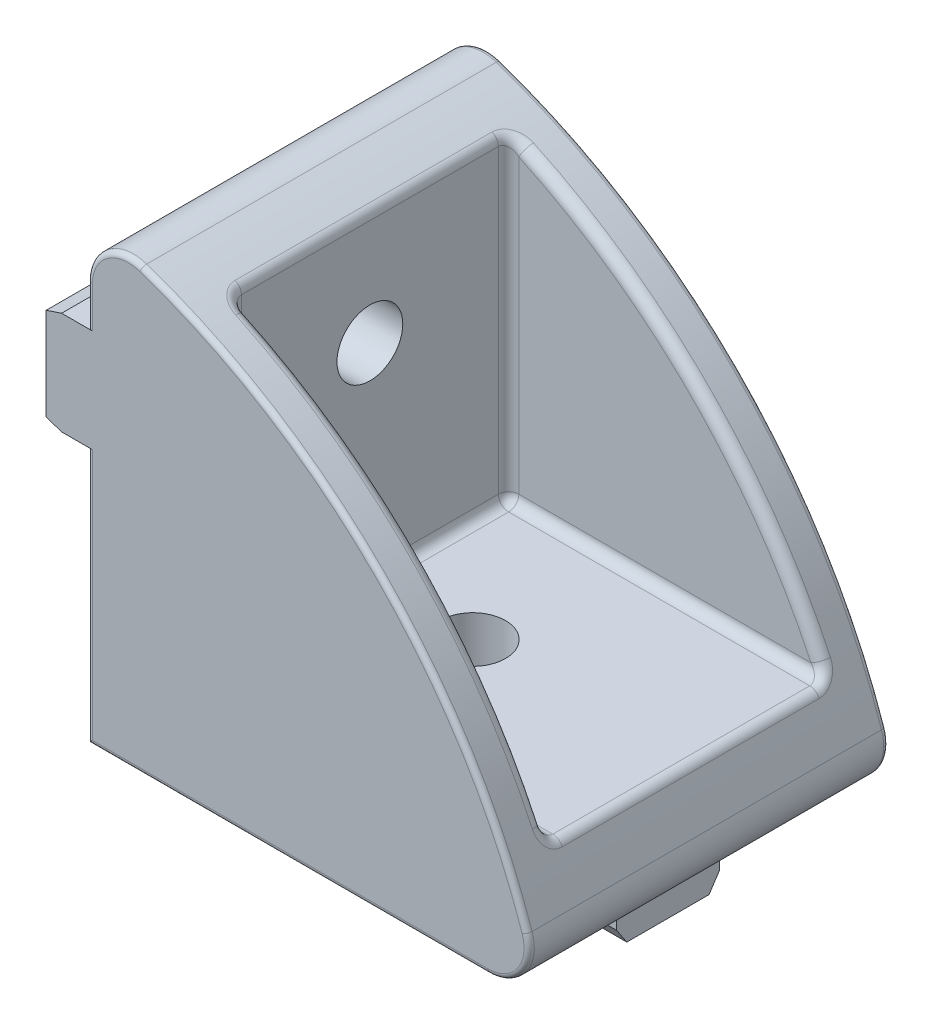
ISO-10303-21;
HEADER;
FILE_DESCRIPTION(('STEP AP214'),'2;1');
FILE_NAME('part.step','',(''),(''),'','','');
FILE_SCHEMA(('AUTOMOTIVE_DESIGN { 1 0 10303 214 1 1 1 1 }'));
ENDSEC;
DATA;
#1=APPLICATION_CONTEXT('core data for automotive mechanical design processes');
#2=APPLICATION_PROTOCOL_DEFINITION('international standard','automotive_design',2000,#1);
#3=PRODUCT_CONTEXT('',#1,'mechanical');
#4=PRODUCT('Part','Part','',(#3));
#5=PRODUCT_RELATED_PRODUCT_CATEGORY('part','',(#4));
#6=PRODUCT_DEFINITION_FORMATION('','',#4);
#7=PRODUCT_DEFINITION_CONTEXT('part definition',#1,'design');
#8=PRODUCT_DEFINITION('design','',#6,#7);
#9=PRODUCT_DEFINITION_SHAPE('','',#8);
#10=(LENGTH_UNIT() NAMED_UNIT(*) SI_UNIT(.MILLI.,.METRE.));
#11=(NAMED_UNIT(*) PLANE_ANGLE_UNIT() SI_UNIT($,.RADIAN.));
#12=(NAMED_UNIT(*) SI_UNIT($,.STERADIAN.) SOLID_ANGLE_UNIT());
#13=UNCERTAINTY_MEASURE_WITH_UNIT(LENGTH_MEASURE(1.E-05),#10,'distance_accuracy_value','');
#14=(GEOMETRIC_REPRESENTATION_CONTEXT(3) GLOBAL_UNCERTAINTY_ASSIGNED_CONTEXT((#13)) GLOBAL_UNIT_ASSIGNED_CONTEXT((#10,
#11,#12)) REPRESENTATION_CONTEXT('',''));
#15=CARTESIAN_POINT('',(0.,0.,0.));
#16=DIRECTION('',(0.,0.,1.));
#17=DIRECTION('',(1.,0.,0.));
#18=AXIS2_PLACEMENT_3D('',#15,#16,#17);
#19=CARTESIAN_POINT('',(-14.0211204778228,-14.0211204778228,17.5));
#20=DIRECTION('',(0.,0.,-1.));
#21=DIRECTION('',(-1.,0.,0.));
#22=AXIS2_PLACEMENT_3D('',#19,#20,#21);
#23=CYLINDRICAL_SURFACE('',#22,60.);
#24=DIRECTION('',(0.,0.,-1.));
#25=VECTOR('',#24,1.);
#26=CARTESIAN_POINT('',(42.7872228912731,5.28722289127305,17.5));
#27=LINE('',#26,#25);
#28=CARTESIAN_POINT('',(42.7872228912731,5.28722289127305,17.));
#29=VERTEX_POINT('',#28);
#30=CARTESIAN_POINT('',(42.7872228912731,5.28722289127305,-17.));
#31=VERTEX_POINT('',#30);
#32=EDGE_CURVE('E365',#29,#31,#27,.T.);
#33=ORIENTED_EDGE('',*,*,#32,.T.);
#34=CARTESIAN_POINT('',(-14.0211204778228,-14.0211204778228,-17.));
#35=DIRECTION('',(0.,0.,-1.));
#36=DIRECTION('',(-1.,0.,0.));
#37=AXIS2_PLACEMENT_3D('',#34,#35,#36);
#38=CIRCLE('',#37,60.);
#39=CARTESIAN_POINT('',(5.28722289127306,42.7872228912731,-17.));
#40=VERTEX_POINT('',#39);
#41=EDGE_CURVE('E715',#31,#40,#38,.F.);
#42=ORIENTED_EDGE('',*,*,#41,.T.);
#43=DIRECTION('',(0.,0.,-1.));
#44=VECTOR('',#43,1.);
#45=CARTESIAN_POINT('',(5.28722289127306,42.7872228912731,17.5));
#46=LINE('',#45,#44);
#47=CARTESIAN_POINT('',(5.28722289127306,42.7872228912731,17.));
#48=VERTEX_POINT('',#47);
#49=EDGE_CURVE('E362',#48,#40,#46,.T.);
#50=ORIENTED_EDGE('',*,*,#49,.F.);
#51=CARTESIAN_POINT('',(-14.0211204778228,-14.0211204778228,17.));
#52=DIRECTION('',(0.,0.,-1.));
#53=DIRECTION('',(-1.,0.,0.));
#54=AXIS2_PLACEMENT_3D('',#51,#52,#53);
#55=CIRCLE('',#54,60.);
#56=EDGE_CURVE('E717',#48,#29,#55,.T.);
#57=ORIENTED_EDGE('',*,*,#56,.T.);
#58=EDGE_LOOP('',(#33,#42,#50,#57));
#59=FACE_BOUND('',#58,.T.);
#60=CARTESIAN_POINT('',(11.3762732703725,39.0516417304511,13.4265087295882));
#61=CARTESIAN_POINT('',(11.8250291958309,40.1281234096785,13.2442601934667));
#62=CARTESIAN_POINT('',(12.1893883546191,39.9511800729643,14.3530174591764));
#63=CARTESIAN_POINT('',(11.3163546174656,39.1098621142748,13.4508647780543));
#64=CARTESIAN_POINT('',(11.7733052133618,40.1522485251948,13.2988435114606));
#65=CARTESIAN_POINT('',(12.0675199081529,40.0103872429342,14.4017295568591));
#66=CARTESIAN_POINT('',(11.2543921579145,39.1695193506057,13.469237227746));
#67=CARTESIAN_POINT('',(11.7120558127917,40.1810081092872,13.3494748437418));
#68=CARTESIAN_POINT('',(11.9414945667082,40.0710556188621,14.4384744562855));
#69=CARTESIAN_POINT('',(11.1283214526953,39.289792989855,13.4938038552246));
#70=CARTESIAN_POINT('',(11.5767936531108,40.244545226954,13.4360036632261));
#71=CARTESIAN_POINT('',(11.6850795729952,40.1933677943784,14.4876077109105));
#72=CARTESIAN_POINT('',(11.064213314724,39.3504093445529,13.4999986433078));
#73=CARTESIAN_POINT('',(11.5030756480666,40.2791836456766,13.4723810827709));
#74=CARTESIAN_POINT('',(11.554690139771,40.2550115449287,14.4999972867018));
#75=CARTESIAN_POINT('',(10.9397669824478,39.4669649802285,13.5000012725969));
#76=CARTESIAN_POINT('',(11.3519248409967,40.3499647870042,13.5252318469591));
#77=CARTESIAN_POINT('',(11.3015789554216,40.3735426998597,14.500002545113));
#78=CARTESIAN_POINT('',(10.8794414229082,39.5229612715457,13.4945531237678));
#79=CARTESIAN_POINT('',(11.2751937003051,40.3857984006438,13.5432141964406));
#80=CARTESIAN_POINT('',(11.1788829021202,40.4304880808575,14.4891062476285));
#81=CARTESIAN_POINT('',(10.760271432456,39.632620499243,13.472727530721));
#82=CARTESIAN_POINT('',(11.1185017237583,40.4586371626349,13.5616131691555));
#83=CARTESIAN_POINT('',(10.9365032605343,40.5420059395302,14.4454550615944));
#84=CARTESIAN_POINT('',(10.701426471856,39.6862842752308,13.4563540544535));
#85=CARTESIAN_POINT('',(11.0384608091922,40.4956870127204,13.5624460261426));
#86=CARTESIAN_POINT('',(10.8168185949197,40.5965792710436,14.4127081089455));
#87=CARTESIAN_POINT('',(10.5867714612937,39.7899762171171,13.4126932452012));
#88=CARTESIAN_POINT('',(10.8789631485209,40.5691337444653,13.5457928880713));
#89=CARTESIAN_POINT('',(10.583621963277,40.7020287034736,14.325386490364));
#90=CARTESIAN_POINT('',(10.5309706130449,39.839993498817,13.3853747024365));
#91=CARTESIAN_POINT('',(10.7993069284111,40.6056289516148,13.5285957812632));
#92=CARTESIAN_POINT('',(10.4701287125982,40.7528937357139,14.270749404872));
#93=CARTESIAN_POINT('',(10.4512502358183,39.9109087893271,13.3365689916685));
#94=CARTESIAN_POINT('',(10.6833279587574,40.6584932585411,13.4890697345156));
#95=CARTESIAN_POINT('',(10.3079855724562,40.8250109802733,14.1731379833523));
#96=CARTESIAN_POINT('',(10.4253363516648,39.9338655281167,13.3189922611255));
#97=CARTESIAN_POINT('',(10.6454387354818,40.6757179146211,13.4737321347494));
#98=CARTESIAN_POINT('',(10.2552793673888,40.8483568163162,14.1379845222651));
#99=CARTESIAN_POINT('',(10.3750308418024,39.9782676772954,13.2812830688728));
#100=CARTESIAN_POINT('',(10.5714065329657,40.7092902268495,13.4386731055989));
#101=CARTESIAN_POINT('',(10.1529630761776,40.8935115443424,14.0625661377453));
#102=CARTESIAN_POINT('',(10.3506412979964,39.9997110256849,13.2611472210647));
#103=CARTESIAN_POINT('',(10.5352268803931,40.7256550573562,13.4189675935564));
#104=CARTESIAN_POINT('',(10.1033572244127,40.9153183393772,14.0222944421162));
#105=CARTESIAN_POINT('',(10.2831026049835,40.0588877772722,13.1997123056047));
#106=CARTESIAN_POINT('',(10.4348088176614,40.7709677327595,13.356378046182));
#107=CARTESIAN_POINT('',(9.96599039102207,40.9754980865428,13.8994246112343));
#108=CARTESIAN_POINT('',(10.2422194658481,40.0944508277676,13.1553162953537));
#109=CARTESIAN_POINT('',(10.3729524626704,40.7987449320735,13.3080132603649));
#110=CARTESIAN_POINT('',(9.88283824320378,41.0116638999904,13.8106325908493));
#111=CARTESIAN_POINT('',(10.1686730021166,40.1581053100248,13.0590713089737));
#112=CARTESIAN_POINT('',(10.2611220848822,40.8487802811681,13.1982338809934));
#113=CARTESIAN_POINT('',(9.73325221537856,41.0763972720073,13.6181426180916));
#114=CARTESIAN_POINT('',(10.1360020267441,40.186203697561,13.0072293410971));
#115=CARTESIAN_POINT('',(10.2108687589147,40.8711656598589,13.1368210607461));
#116=CARTESIAN_POINT('',(9.6668027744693,41.1049719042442,13.5144586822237));
#117=CARTESIAN_POINT('',(10.0828937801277,40.2317166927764,12.9025497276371));
#118=CARTESIAN_POINT('',(10.1289972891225,40.9075401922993,13.0096759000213));
#119=CARTESIAN_POINT('',(9.55878600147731,41.1512563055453,13.3050994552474));
#120=CARTESIAN_POINT('',(10.061624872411,40.249861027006,12.8502139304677));
#121=CARTESIAN_POINT('',(10.095957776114,40.922171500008,12.9447698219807));
#122=CARTESIAN_POINT('',(9.51552720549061,41.1697081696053,13.200427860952));
#123=CARTESIAN_POINT('',(10.0281357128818,40.2783760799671,12.7422262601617));
#124=CARTESIAN_POINT('',(10.0439426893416,40.9451737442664,12.8092687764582));
#125=CARTESIAN_POINT('',(9.44741366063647,41.198706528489,12.9844525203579));
#126=CARTESIAN_POINT('',(10.0159123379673,40.2887494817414,12.6865755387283));
#127=CARTESIAN_POINT('',(10.0248380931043,40.9536019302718,12.7385368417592));
#128=CARTESIAN_POINT('',(9.42255255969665,41.2092557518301,12.8731510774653));
#129=CARTESIAN_POINT('',(10.001617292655,40.30087599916,12.5776726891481));
#130=CARTESIAN_POINT('',(10.0025386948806,40.9634365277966,12.5995784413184));
#131=CARTESIAN_POINT('',(9.39347789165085,41.2215878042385,12.6553453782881));
#132=CARTESIAN_POINT('',(9.99890078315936,40.3031767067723,12.5245216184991));
#133=CARTESIAN_POINT('',(9.998285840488,40.9653099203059,12.5313810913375));
#134=CARTESIAN_POINT('',(9.38795278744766,41.2239275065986,12.5490432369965));
#135=CARTESIAN_POINT('',(10.0011582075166,40.301262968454,12.4450139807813));
#136=CARTESIAN_POINT('',(10.0018076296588,40.9637574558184,12.4295858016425));
#137=CARTESIAN_POINT('',(9.3925441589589,41.2219813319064,12.3900279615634));
#138=CARTESIAN_POINT('',(10.0029726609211,40.2997253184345,12.4185130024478));
#139=CARTESIAN_POINT('',(10.0046434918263,40.9625076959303,12.3956604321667));
#140=CARTESIAN_POINT('',(9.39623457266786,41.2204176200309,12.337026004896));
#141=CARTESIAN_POINT('',(10.0086943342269,40.2948728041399,12.3657745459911));
#142=CARTESIAN_POINT('',(10.0135700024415,40.9585716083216,12.3282901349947));
#143=CARTESIAN_POINT('',(9.40787187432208,41.2154828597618,12.2315490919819));
#144=CARTESIAN_POINT('',(10.0126018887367,40.2915576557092,12.3395371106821));
#145=CARTESIAN_POINT('',(10.0196659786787,40.9558829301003,12.2948274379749));
#146=CARTESIAN_POINT('',(9.41581944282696,41.2121115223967,12.1790742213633));
#147=CARTESIAN_POINT('',(10.0175414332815,40.2873640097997,12.3135189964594));
#148=CARTESIAN_POINT('',(10.0273609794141,40.9524872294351,12.2617855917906));
#149=CARTESIAN_POINT('',(9.42586597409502,41.2078467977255,12.1270379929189));
#150=(BOUNDED_SURFACE() B_SPLINE_SURFACE(3,2,((#60,#61,#62),(#63,#64,#65),(#66,#67,#68),(#69,
#70,#71),(#72,#73,#74),(#75,#76,#77),(#78,#79,#80),(#81,#82,#83),(#84,#85,#86),(#87,#88,#89),
(#90,#91,#92),(#93,#94,#95),(#96,#97,#98),(#99,#100,#101),(#102,#103,#104),(#105,#106,#107),
(#108,#109,#110),(#111,#112,#113),(#114,#115,#116),(#117,#118,#119),(#120,#121,#122),(#123,#124,
#125),(#126,#127,#128),(#129,#130,#131),(#132,#133,#134),(#135,#136,#137),(#138,#139,#140),
(#141,#142,#143),(#144,#145,#146),(#147,#148,#149)),.UNSPECIFIED.,.F.,.F.,
.F.) B_SPLINE_SURFACE_WITH_KNOTS((4,2,2,2,2,2,2,2,2,2,2,2,2,2,4),(3,3),(0.,0.424939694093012,
0.849858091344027,1.24843769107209,1.6468726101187,2.04645184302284,2.24630676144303,
2.44642892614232,2.82172004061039,3.19666021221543,3.53813573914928,3.8794933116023,
4.19719364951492,4.35646595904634,4.51576373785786),(0.,1.),
.UNSPECIFIED.) GEOMETRIC_REPRESENTATION_ITEM() RATIONAL_B_SPLINE_SURFACE(((1.,0.646385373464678,
1.),(1.,0.656820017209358,1.),(1.,0.667185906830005,1.),(1.,0.687514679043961,1.),(1.,
0.697477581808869,1.),(1.,0.716139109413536,1.),(1.,0.72487782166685,1.),(1.,0.741612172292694,
1.),(1.,0.749608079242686,1.),(1.,0.764749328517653,1.),(1.,0.77189216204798,1.),(1.,
0.781842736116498,1.),(1.,0.785032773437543,1.),(1.,0.791151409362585,1.),(1.,0.79407965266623,
1.),(1.,0.80209890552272,1.),(1.,0.806839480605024,1.),(1.,0.815232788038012,1.),(1.,
0.818886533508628,1.),(1.,0.82476020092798,1.),(1.,0.827078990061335,1.),(1.,0.830708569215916,
1.),(1.,0.832019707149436,1.),(1.,0.833551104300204,1.),(1.,0.833840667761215,1.),(1.,
0.833599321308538,1.),(1.,0.833405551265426,1.),(1.,0.832793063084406,1.),(1.,0.832374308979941,
1.),(1.,0.831843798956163,1.))) REPRESENTATION_ITEM('') SURFACE());
#151=CARTESIAN_POINT('',(9.42586597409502,41.2078467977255,12.1270379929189));
#152=CARTESIAN_POINT('',(9.41581944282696,41.2121115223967,12.1790742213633));
#153=CARTESIAN_POINT('',(9.40787187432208,41.2154828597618,12.2315490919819));
#154=CARTESIAN_POINT('',(9.39623457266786,41.2204176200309,12.337026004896));
#155=CARTESIAN_POINT('',(9.3925441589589,41.2219813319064,12.3900279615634));
#156=CARTESIAN_POINT('',(9.38795278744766,41.2239275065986,12.5490432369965));
#157=CARTESIAN_POINT('',(9.39347789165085,41.2215878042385,12.6553453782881));
#158=CARTESIAN_POINT('',(9.42255255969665,41.2092557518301,12.8731510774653));
#159=CARTESIAN_POINT('',(9.44741366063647,41.198706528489,12.9844525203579));
#160=CARTESIAN_POINT('',(9.51552720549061,41.1697081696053,13.200427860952));
#161=CARTESIAN_POINT('',(9.5587860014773,41.1512563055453,13.3050994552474));
#162=CARTESIAN_POINT('',(9.6668027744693,41.1049719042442,13.5144586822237));
#163=CARTESIAN_POINT('',(9.73325221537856,41.0763972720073,13.6181426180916));
#164=CARTESIAN_POINT('',(9.88283824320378,41.0116638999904,13.8106325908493));
#165=CARTESIAN_POINT('',(9.96599039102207,40.9754980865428,13.8994246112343));
#166=CARTESIAN_POINT('',(10.1033572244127,40.9153183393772,14.0222944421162));
#167=CARTESIAN_POINT('',(10.1529630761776,40.8935115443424,14.0625661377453));
#168=CARTESIAN_POINT('',(10.2552793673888,40.8483568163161,14.1379845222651));
#169=CARTESIAN_POINT('',(10.3079855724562,40.8250109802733,14.1731379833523));
#170=CARTESIAN_POINT('',(10.4701287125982,40.7528937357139,14.270749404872));
#171=CARTESIAN_POINT('',(10.583621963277,40.7020287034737,14.325386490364));
#172=CARTESIAN_POINT('',(10.8168185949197,40.5965792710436,14.4127081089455));
#173=CARTESIAN_POINT('',(10.9365032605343,40.5420059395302,14.4454550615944));
#174=CARTESIAN_POINT('',(11.1788829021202,40.4304880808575,14.4891062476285));
#175=CARTESIAN_POINT('',(11.3015789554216,40.3735426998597,14.500002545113));
#176=CARTESIAN_POINT('',(11.554690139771,40.2550115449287,14.4999972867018));
#177=CARTESIAN_POINT('',(11.6850795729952,40.1933677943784,14.4876077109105));
#178=CARTESIAN_POINT('',(11.9414945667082,40.0710556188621,14.4384744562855));
#179=CARTESIAN_POINT('',(12.0675199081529,40.0103872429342,14.4017295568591));
#180=CARTESIAN_POINT('',(12.1893883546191,39.9511800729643,14.3530174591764));
#181=B_SPLINE_CURVE_WITH_KNOTS('',3,(#151,#152,#153,#154,#155,#156,#157,#158,#159,#160,#161,
#162,#163,#164,#165,#166,#167,#168,#169,#170,#171,#172,#173,#174,#175,#176,#177,#178,#179,#180),
.UNSPECIFIED.,.F.,.F.,(4,2,2,2,2,2,2,2,2,2,2,2,2,2,4),(0.,0.159297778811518,0.31857008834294,
0.636270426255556,0.977627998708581,1.31910352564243,1.69404369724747,2.06933481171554,
2.26945697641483,2.46931189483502,2.86889112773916,3.26732604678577,3.66590564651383,
4.09082404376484,4.51576373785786),.UNSPECIFIED.);
#182=CARTESIAN_POINT('',(9.39018848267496,41.2229797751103,12.5));
#183=VERTEX_POINT('',#182);
#184=CARTESIAN_POINT('',(11.4240867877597,40.3161726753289,14.5));
#185=VERTEX_POINT('',#184);
#186=EDGE_CURVE('E454',#183,#185,#181,.T.);
#187=ORIENTED_EDGE('',*,*,#186,.F.);
#188=DIRECTION('',(0.,0.,-1.));
#189=VECTOR('',#188,1.);
#190=CARTESIAN_POINT('',(9.39018848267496,41.2229797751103,17.5));
#191=LINE('',#190,#189);
#192=CARTESIAN_POINT('',(9.39018848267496,41.2229797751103,-12.5));
#193=VERTEX_POINT('',#192);
#194=EDGE_CURVE('E446',#183,#193,#191,.T.);
#195=ORIENTED_EDGE('',*,*,#194,.T.);
#196=CARTESIAN_POINT('',(10.0479790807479,40.2614796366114,-12.1939670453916));
#197=CARTESIAN_POINT('',(10.0747055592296,40.9315694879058,-12.110825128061));
#198=CARTESIAN_POINT('',(9.4877730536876,41.1815237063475,-11.8879340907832));
#199=CARTESIAN_POINT('',(10.0400847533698,40.2682031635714,-12.2185232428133));
#200=CARTESIAN_POINT('',(10.062458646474,40.9369863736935,-12.1415583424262));
#201=CARTESIAN_POINT('',(9.47171679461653,41.1883611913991,-11.9370464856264));
#202=CARTESIAN_POINT('',(10.0331295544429,40.2741193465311,-12.2434252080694));
#203=CARTESIAN_POINT('',(10.0516389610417,40.9417675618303,-12.1729429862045));
#204=CARTESIAN_POINT('',(9.45757062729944,41.1943776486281,-11.9868504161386));
#205=CARTESIAN_POINT('',(10.0211533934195,40.284298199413,-12.2937733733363));
#206=CARTESIAN_POINT('',(10.0329989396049,40.9499996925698,-12.2366482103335));
#207=CARTESIAN_POINT('',(9.43321233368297,41.2047290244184,-12.0875467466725));
#208=CARTESIAN_POINT('',(10.0161324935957,40.2885608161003,-12.3192195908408));
#209=CARTESIAN_POINT('',(10.0251692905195,40.9534547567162,-12.2689836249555));
#210=CARTESIAN_POINT('',(9.42300033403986,41.2090638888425,-12.1384391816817));
#211=CARTESIAN_POINT('',(10.0040711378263,40.2987965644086,-12.3960541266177));
#212=CARTESIAN_POINT('',(10.0063752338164,40.9617457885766,-12.3668133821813));
#213=CARTESIAN_POINT('',(9.3984687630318,41.2194731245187,-12.2921082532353));
#214=CARTESIAN_POINT('',(10.0000017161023,40.3022433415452,-12.4480324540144));
#215=CARTESIAN_POINT('',(10.0000028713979,40.9645529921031,-12.433447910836));
#216=CARTESIAN_POINT('',(9.39019197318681,41.2229783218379,-12.3960649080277));
#217=CARTESIAN_POINT('',(9.9999982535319,40.302246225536,-12.552887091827));
#218=CARTESIAN_POINT('',(9.999997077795,40.9645555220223,-12.5677296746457));
#219=CARTESIAN_POINT('',(9.39018493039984,41.2229812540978,-12.6057741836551));
#220=CARTESIAN_POINT('',(10.004209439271,40.2986793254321,-12.6057630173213));
#221=CARTESIAN_POINT('',(10.0065911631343,40.961650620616,-12.6355187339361));
#222=CARTESIAN_POINT('',(9.39875005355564,41.2193538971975,-12.7115260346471));
#223=CARTESIAN_POINT('',(10.020866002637,40.2845436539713,-12.709947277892));
#224=CARTESIAN_POINT('',(10.032560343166,40.9501940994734,-12.7682123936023));
#225=CARTESIAN_POINT('',(9.43262780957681,41.2049786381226,-12.9198945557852));
#226=CARTESIAN_POINT('',(10.0333094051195,40.27397656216,-12.7612559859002));
#227=CARTESIAN_POINT('',(10.0519876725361,40.9416194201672,-12.8332535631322));
#228=CARTESIAN_POINT('',(9.45793642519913,41.1942324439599,-13.022511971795));
#229=CARTESIAN_POINT('',(10.0658870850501,40.2462242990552,-12.8607938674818));
#230=CARTESIAN_POINT('',(10.1025589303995,40.9192478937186,-12.9578662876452));
#231=CARTESIAN_POINT('',(9.52419611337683,41.1660098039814,-13.2215877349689));
#232=CARTESIAN_POINT('',(10.086009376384,40.2290494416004,-12.9090277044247));
#233=CARTESIAN_POINT('',(10.1337878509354,40.905413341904,-13.017553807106));
#234=CARTESIAN_POINT('',(9.56512280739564,41.1485438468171,-13.3180554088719));
#235=CARTESIAN_POINT('',(10.1331753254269,40.1886232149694,-13.0013001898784));
#236=CARTESIAN_POINT('',(10.2064605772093,40.8731225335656,-13.1295072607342));
#237=CARTESIAN_POINT('',(9.66105355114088,41.1074324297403,-13.5026003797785));
#238=CARTESIAN_POINT('',(10.1602220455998,40.1653691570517,-13.0453369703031));
#239=CARTESIAN_POINT('',(10.2480474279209,40.8546021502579,-13.1818350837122));
#240=CARTESIAN_POINT('',(9.71606382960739,41.0837842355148,-13.5906739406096));
#241=CARTESIAN_POINT('',(10.2212014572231,40.1126730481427,-13.1294875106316));
#242=CARTESIAN_POINT('',(10.3409871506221,40.8130643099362,-13.2788873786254));
#243=CARTESIAN_POINT('',(9.84008975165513,41.0301949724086,-13.7589750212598));
#244=CARTESIAN_POINT('',(10.2553188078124,40.083064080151,-13.1694409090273));
#245=CARTESIAN_POINT('',(10.3927583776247,40.7898545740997,-13.3233353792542));
#246=CARTESIAN_POINT('',(9.90948097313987,41.0000841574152,-13.8388818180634));
#247=CARTESIAN_POINT('',(10.328761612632,40.0189410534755,-13.2430645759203));
#248=CARTESIAN_POINT('',(10.5029404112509,40.7402558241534,-13.4013672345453));
#249=CARTESIAN_POINT('',(10.0588561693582,40.9348742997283,-13.9861291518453));
#250=CARTESIAN_POINT('',(10.3680880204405,39.9844260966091,-13.2767336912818));
#251=CARTESIAN_POINT('',(10.5615310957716,40.7137837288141,-13.4349061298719));
#252=CARTESIAN_POINT('',(10.1388420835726,40.8997743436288,-14.0534673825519));
#253=CARTESIAN_POINT('',(10.4539284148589,39.9085882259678,-13.3395489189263));
#254=CARTESIAN_POINT('',(10.6876946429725,40.6565350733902,-13.4925099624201));
#255=CARTESIAN_POINT('',(10.3134327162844,40.822651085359,-14.179097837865));
#256=CARTESIAN_POINT('',(10.5007605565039,39.8669484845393,-13.3681641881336));
#257=CARTESIAN_POINT('',(10.755746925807,40.6255195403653,-13.51552163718));
#258=CARTESIAN_POINT('',(10.4086845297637,40.7803055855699,-14.2363283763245));
#259=CARTESIAN_POINT('',(10.5977760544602,39.7800327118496,-13.4171547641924));
#260=CARTESIAN_POINT('',(10.8940436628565,40.5621982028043,-13.5478403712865));
#261=CARTESIAN_POINT('',(10.6060041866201,40.6919166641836,-14.3343095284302));
#262=CARTESIAN_POINT('',(10.6479611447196,39.7347547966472,-13.4375257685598));
#263=CARTESIAN_POINT('',(10.9644579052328,40.5298098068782,-13.5569464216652));
#264=CARTESIAN_POINT('',(10.7080755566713,40.645871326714,-14.3750515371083));
#265=CARTESIAN_POINT('',(10.7546881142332,39.6377051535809,-13.4711889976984));
#266=CARTESIAN_POINT('',(11.11069007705,40.4622596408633,-13.5618437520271));
#267=CARTESIAN_POINT('',(10.9251473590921,40.5471767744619,-14.4423779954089));
#268=CARTESIAN_POINT('',(10.8114105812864,39.5857070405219,-13.4837465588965));
#269=CARTESIAN_POINT('',(11.1864839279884,40.4270784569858,-13.5561475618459));
#270=CARTESIAN_POINT('',(11.0405150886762,40.4942973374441,-14.4674931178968));
#271=CARTESIAN_POINT('',(10.9257819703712,39.4799590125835,-13.4989113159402));
#272=CARTESIAN_POINT('',(11.3340396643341,40.3583309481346,-13.5298271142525));
#273=CARTESIAN_POINT('',(11.273134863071,40.3867569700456,-14.4978226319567));
#274=CARTESIAN_POINT('',(10.983431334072,39.4262082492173,-13.5015136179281));
#275=CARTESIAN_POINT('',(11.4058371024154,40.3247418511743,-13.5088281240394));
#276=CARTESIAN_POINT('',(11.390387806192,40.3320951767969,-14.5030272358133));
#277=CARTESIAN_POINT('',(11.1018901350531,39.3148188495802,-13.4966688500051));
#278=CARTESIAN_POINT('',(11.5465216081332,40.2587841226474,-13.4516741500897));
#279=CARTESIAN_POINT('',(11.6313209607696,40.2188178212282,-14.4933377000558));
#280=CARTESIAN_POINT('',(11.1626670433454,39.2571505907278,-13.4885713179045));
#281=CARTESIAN_POINT('',(11.6147090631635,40.2267297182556,-13.4142406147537));
#282=CARTESIAN_POINT('',(11.7549350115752,40.1601721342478,-14.4771426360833));
#283=CARTESIAN_POINT('',(11.2819911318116,39.1429706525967,-13.4613720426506));
#284=CARTESIAN_POINT('',(11.7394352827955,40.1681545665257,-13.3274616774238));
#285=CARTESIAN_POINT('',(11.997628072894,40.0440569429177,-14.4227440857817));
#286=CARTESIAN_POINT('',(11.340538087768,39.0864590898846,-13.4422691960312));
#287=CARTESIAN_POINT('',(11.7956862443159,40.1417708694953,-13.2777170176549));
#288=CARTESIAN_POINT('',(12.1167066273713,39.9865875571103,-14.3845383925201));
#289=CARTESIAN_POINT('',(11.3971289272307,39.0313652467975,-13.4177628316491));
#290=CARTESIAN_POINT('',(11.8431782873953,40.1196667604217,-13.2247509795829));
#291=CARTESIAN_POINT('',(12.2318066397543,39.9305599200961,-14.3355256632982));
#292=(BOUNDED_SURFACE() B_SPLINE_SURFACE(3,2,((#196,#197,#198),(#199,#200,#201),(#202,#203,
#204),(#205,#206,#207),(#208,#209,#210),(#211,#212,#213),(#214,#215,#216),(#217,#218,#219),
(#220,#221,#222),(#223,#224,#225),(#226,#227,#228),(#229,#230,#231),(#232,#233,#234),(#235,#236,
#237),(#238,#239,#240),(#241,#242,#243),(#244,#245,#246),(#247,#248,#249),(#250,#251,#252),
(#253,#254,#255),(#256,#257,#258),(#259,#260,#261),(#262,#263,#264),(#265,#266,#267),(#268,#269,
#270),(#271,#272,#273),(#274,#275,#276),(#277,#278,#279),(#280,#281,#282),(#283,#284,#285),
(#286,#287,#288),(#289,#290,#291)),.UNSPECIFIED.,.F.,.F.,.F.) B_SPLINE_SURFACE_WITH_KNOTS((4,2,
2,2,2,2,2,2,2,2,2,2,2,2,2,4),(3,3),(0.,0.155983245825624,0.311971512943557,0.623357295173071,
0.940252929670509,1.25707255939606,1.57339966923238,1.88986692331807,2.21597417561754,
2.54214120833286,2.89284665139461,3.24373488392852,3.62397428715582,4.00440058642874,
4.40905116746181,4.81374232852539),(0.,1.),
.UNSPECIFIED.) GEOMETRIC_REPRESENTATION_ITEM() RATIONAL_B_SPLINE_SURFACE(((1.,0.828557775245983,
1.),(1.,0.829414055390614,1.),(1.,0.830165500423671,1.),(1.,0.83145615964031,1.),(1.,
0.831995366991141,1.),(1.,0.833289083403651,1.),(1.,0.833722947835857,1.),(1.,0.833723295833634,
1.),(1.,0.833274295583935,1.),(1.,0.831487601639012,1.),(1.,0.830150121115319,1.),(1.,
0.826614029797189,1.),(1.,0.824416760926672,1.),(1.,0.819197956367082,1.),(1.,0.816176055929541,
1.),(1.,0.809251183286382,1.),(1.,0.805324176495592,1.),(1.,0.796703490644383,1.),(1.,
0.792009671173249,1.),(1.,0.781536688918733,1.),(1.,0.775702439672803,1.),(1.,0.763298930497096,
1.),(1.,0.756729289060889,1.),(1.,0.742364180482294,1.),(1.,0.734512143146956,1.),(1.,
0.718169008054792,1.),(1.,0.709677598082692,1.),(1.,0.691640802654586,1.),(1.,0.682062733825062,
1.),(1.,0.662584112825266,1.),(1.,0.65268352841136,1.),(1.,0.642742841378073,1.))) REPRESENTATION_ITEM('') SURFACE());
#293=CARTESIAN_POINT('',(12.2318066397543,39.9305599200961,-14.3355256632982));
#294=CARTESIAN_POINT('',(12.1167066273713,39.9865875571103,-14.3845383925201));
#295=CARTESIAN_POINT('',(11.997628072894,40.0440569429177,-14.4227440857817));
#296=CARTESIAN_POINT('',(11.7549350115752,40.1601721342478,-14.4771426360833));
#297=CARTESIAN_POINT('',(11.6313209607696,40.2188178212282,-14.4933377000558));
#298=CARTESIAN_POINT('',(11.390387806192,40.3320951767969,-14.5030272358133));
#299=CARTESIAN_POINT('',(11.273134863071,40.3867569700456,-14.4978226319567));
#300=CARTESIAN_POINT('',(11.0405150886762,40.4942973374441,-14.4674931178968));
#301=CARTESIAN_POINT('',(10.9251473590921,40.5471767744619,-14.4423779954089));
#302=CARTESIAN_POINT('',(10.7080755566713,40.645871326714,-14.3750515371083));
#303=CARTESIAN_POINT('',(10.6060041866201,40.6919166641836,-14.3343095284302));
#304=CARTESIAN_POINT('',(10.4086845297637,40.7803055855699,-14.2363283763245));
#305=CARTESIAN_POINT('',(10.3134327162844,40.822651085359,-14.179097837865));
#306=CARTESIAN_POINT('',(10.1388420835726,40.8997743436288,-14.0534673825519));
#307=CARTESIAN_POINT('',(10.0588561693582,40.9348742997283,-13.9861291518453));
#308=CARTESIAN_POINT('',(9.90948097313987,41.0000841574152,-13.8388818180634));
#309=CARTESIAN_POINT('',(9.84008975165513,41.0301949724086,-13.7589750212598));
#310=CARTESIAN_POINT('',(9.71606382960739,41.0837842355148,-13.5906739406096));
#311=CARTESIAN_POINT('',(9.66105355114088,41.1074324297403,-13.5026003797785));
#312=CARTESIAN_POINT('',(9.56512280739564,41.1485438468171,-13.3180554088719));
#313=CARTESIAN_POINT('',(9.52419611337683,41.1660098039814,-13.2215877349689));
#314=CARTESIAN_POINT('',(9.45793642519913,41.1942324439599,-13.022511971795));
#315=CARTESIAN_POINT('',(9.43262780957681,41.2049786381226,-12.9198945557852));
#316=CARTESIAN_POINT('',(9.39875005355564,41.2193538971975,-12.7115260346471));
#317=CARTESIAN_POINT('',(9.39018493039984,41.2229812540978,-12.6057741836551));
#318=CARTESIAN_POINT('',(9.3901919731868,41.2229783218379,-12.3960649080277));
#319=CARTESIAN_POINT('',(9.3984687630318,41.2194731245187,-12.2921082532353));
#320=CARTESIAN_POINT('',(9.42300033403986,41.2090638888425,-12.1384391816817));
#321=CARTESIAN_POINT('',(9.43321233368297,41.2047290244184,-12.0875467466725));
#322=CARTESIAN_POINT('',(9.45757062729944,41.1943776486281,-11.9868504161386));
#323=CARTESIAN_POINT('',(9.47171679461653,41.1883611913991,-11.9370464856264));
#324=CARTESIAN_POINT('',(9.4877730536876,41.1815237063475,-11.8879340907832));
#325=B_SPLINE_CURVE_WITH_KNOTS('',3,(#293,#294,#295,#296,#297,#298,#299,#300,#301,#302,#303,
#304,#305,#306,#307,#308,#309,#310,#311,#312,#313,#314,#315,#316,#317,#318,#319,#320,#321,#322,
#323,#324),.UNSPECIFIED.,.F.,.F.,(4,2,2,2,2,2,2,2,2,2,2,2,2,2,2,4),(0.,0.404691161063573,
0.809341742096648,1.18976804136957,1.57000744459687,1.92089567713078,2.27160112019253,
2.59776815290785,2.92387540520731,3.24034265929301,3.55666976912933,3.87348939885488,
4.19038503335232,4.50177081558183,4.65775908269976,4.81374232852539),.UNSPECIFIED.);
#326=CARTESIAN_POINT('',(11.4240867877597,40.316172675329,-14.5));
#327=VERTEX_POINT('',#326);
#328=EDGE_CURVE('E437',#327,#193,#325,.T.);
#329=ORIENTED_EDGE('',*,*,#328,.F.);
#330=CARTESIAN_POINT('',(-14.0211204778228,-14.0211204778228,-14.5));
#331=DIRECTION('',(0.,0.,-1.));
#332=DIRECTION('',(-1.,0.,0.));
#333=AXIS2_PLACEMENT_3D('',#330,#331,#332);
#334=CIRCLE('',#333,60.);
#335=CARTESIAN_POINT('',(40.316172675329,11.4240867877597,-14.5));
#336=VERTEX_POINT('',#335);
#337=EDGE_CURVE('E972',#327,#336,#334,.T.);
#338=ORIENTED_EDGE('',*,*,#337,.T.);
#339=CARTESIAN_POINT('',(39.0516417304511,11.3762732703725,-13.4265087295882));
#340=CARTESIAN_POINT('',(40.1281234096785,11.8250291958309,-13.2442601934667));
#341=CARTESIAN_POINT('',(39.9511800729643,12.1893883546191,-14.3530174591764));
#342=CARTESIAN_POINT('',(39.1098621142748,11.3163546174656,-13.4508647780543));
#343=CARTESIAN_POINT('',(40.1522485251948,11.7733052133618,-13.2988435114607));
#344=CARTESIAN_POINT('',(40.0103872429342,12.0675199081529,-14.4017295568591));
#345=CARTESIAN_POINT('',(39.1695193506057,11.2543921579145,-13.469237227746));
#346=CARTESIAN_POINT('',(40.1810081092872,11.7120558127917,-13.3494748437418));
#347=CARTESIAN_POINT('',(40.0710556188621,11.9414945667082,-14.4384744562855));
#348=CARTESIAN_POINT('',(39.289792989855,11.1283214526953,-13.4938038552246));
#349=CARTESIAN_POINT('',(40.244545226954,11.5767936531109,-13.4360036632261));
#350=CARTESIAN_POINT('',(40.1933677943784,11.6850795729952,-14.4876077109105));
#351=CARTESIAN_POINT('',(39.3504093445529,11.064213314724,-13.4999986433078));
#352=CARTESIAN_POINT('',(40.2791836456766,11.5030756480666,-13.4723810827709));
#353=CARTESIAN_POINT('',(40.2550115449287,11.554690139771,-14.4999972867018));
#354=CARTESIAN_POINT('',(39.4669649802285,10.9397669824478,-13.5000012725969));
#355=CARTESIAN_POINT('',(40.3499647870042,11.3519248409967,-13.5252318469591));
#356=CARTESIAN_POINT('',(40.3735426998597,11.3015789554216,-14.500002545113));
#357=CARTESIAN_POINT('',(39.5229612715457,10.8794414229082,-13.4945531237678));
#358=CARTESIAN_POINT('',(40.3857984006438,11.2751937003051,-13.5432141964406));
#359=CARTESIAN_POINT('',(40.4304880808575,11.1788829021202,-14.4891062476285));
#360=CARTESIAN_POINT('',(39.632620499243,10.760271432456,-13.472727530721));
#361=CARTESIAN_POINT('',(40.4586371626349,11.1185017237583,-13.5616131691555));
#362=CARTESIAN_POINT('',(40.5420059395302,10.9365032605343,-14.4454550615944));
#363=CARTESIAN_POINT('',(39.6862842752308,10.701426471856,-13.4563540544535));
#364=CARTESIAN_POINT('',(40.4956870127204,11.0384608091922,-13.5624460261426));
#365=CARTESIAN_POINT('',(40.5965792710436,10.8168185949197,-14.4127081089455));
#366=CARTESIAN_POINT('',(39.7899762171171,10.5867714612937,-13.4126932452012));
#367=CARTESIAN_POINT('',(40.5691337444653,10.8789631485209,-13.5457928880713));
#368=CARTESIAN_POINT('',(40.7020287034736,10.583621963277,-14.325386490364));
#369=CARTESIAN_POINT('',(39.839993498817,10.5309706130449,-13.3853747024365));
#370=CARTESIAN_POINT('',(40.6056289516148,10.7993069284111,-13.5285957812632));
#371=CARTESIAN_POINT('',(40.7528937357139,10.4701287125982,-14.270749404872));
#372=CARTESIAN_POINT('',(39.9109087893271,10.4512502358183,-13.3365689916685));
#373=CARTESIAN_POINT('',(40.6584932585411,10.6833279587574,-13.4890697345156));
#374=CARTESIAN_POINT('',(40.8250109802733,10.3079855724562,-14.1731379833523));
#375=CARTESIAN_POINT('',(39.9338655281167,10.4253363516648,-13.3189922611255));
#376=CARTESIAN_POINT('',(40.6757179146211,10.6454387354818,-13.4737321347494));
#377=CARTESIAN_POINT('',(40.8483568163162,10.2552793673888,-14.1379845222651));
#378=CARTESIAN_POINT('',(39.9782676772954,10.3750308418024,-13.2812830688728));
#379=CARTESIAN_POINT('',(40.7092902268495,10.5714065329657,-13.4386731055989));
#380=CARTESIAN_POINT('',(40.8935115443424,10.1529630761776,-14.0625661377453));
#381=CARTESIAN_POINT('',(39.9997110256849,10.3506412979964,-13.2611472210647));
#382=CARTESIAN_POINT('',(40.7256550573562,10.5352268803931,-13.4189675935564));
#383=CARTESIAN_POINT('',(40.9153183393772,10.1033572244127,-14.0222944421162));
#384=CARTESIAN_POINT('',(40.0588877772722,10.2831026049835,-13.1997123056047));
#385=CARTESIAN_POINT('',(40.7709677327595,10.4348088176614,-13.356378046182));
#386=CARTESIAN_POINT('',(40.9754980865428,9.96599039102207,-13.8994246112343));
#387=CARTESIAN_POINT('',(40.0944508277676,10.2422194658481,-13.1553162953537));
#388=CARTESIAN_POINT('',(40.7987449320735,10.3729524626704,-13.3080132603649));
#389=CARTESIAN_POINT('',(41.0116638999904,9.88283824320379,-13.8106325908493));
#390=CARTESIAN_POINT('',(40.1581053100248,10.1686730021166,-13.0590713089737));
#391=CARTESIAN_POINT('',(40.8487802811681,10.2611220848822,-13.1982338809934));
#392=CARTESIAN_POINT('',(41.0763972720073,9.73325221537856,-13.6181426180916));
#393=CARTESIAN_POINT('',(40.186203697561,10.1360020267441,-13.0072293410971));
#394=CARTESIAN_POINT('',(40.8711656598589,10.2108687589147,-13.1368210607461));
#395=CARTESIAN_POINT('',(41.1049719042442,9.66680277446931,-13.5144586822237));
#396=CARTESIAN_POINT('',(40.2317166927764,10.0828937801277,-12.9025497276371));
#397=CARTESIAN_POINT('',(40.9075401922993,10.1289972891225,-13.0096759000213));
#398=CARTESIAN_POINT('',(41.1512563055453,9.55878600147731,-13.3050994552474));
#399=CARTESIAN_POINT('',(40.249861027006,10.061624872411,-12.8502139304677));
#400=CARTESIAN_POINT('',(40.922171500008,10.095957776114,-12.9447698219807));
#401=CARTESIAN_POINT('',(41.1697081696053,9.5155272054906,-13.200427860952));
#402=CARTESIAN_POINT('',(40.2783760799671,10.0281357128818,-12.7422262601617));
#403=CARTESIAN_POINT('',(40.9451737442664,10.0439426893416,-12.8092687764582));
#404=CARTESIAN_POINT('',(41.198706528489,9.44741366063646,-12.9844525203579));
#405=CARTESIAN_POINT('',(40.2887494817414,10.0159123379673,-12.6865755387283));
#406=CARTESIAN_POINT('',(40.9536019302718,10.0248380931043,-12.7385368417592));
#407=CARTESIAN_POINT('',(41.2092557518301,9.42255255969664,-12.8731510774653));
#408=CARTESIAN_POINT('',(40.30087599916,10.001617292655,-12.5776726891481));
#409=CARTESIAN_POINT('',(40.9634365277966,10.0025386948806,-12.5995784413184));
#410=CARTESIAN_POINT('',(41.2215878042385,9.39347789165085,-12.6553453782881));
#411=CARTESIAN_POINT('',(40.3031767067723,9.99890078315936,-12.5245216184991));
#412=CARTESIAN_POINT('',(40.9653099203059,9.998285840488,-12.5313810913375));
#413=CARTESIAN_POINT('',(41.2239275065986,9.38795278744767,-12.5490432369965));
#414=CARTESIAN_POINT('',(40.301262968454,10.0011582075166,-12.4450139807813));
#415=CARTESIAN_POINT('',(40.9637574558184,10.0018076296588,-12.4295858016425));
#416=CARTESIAN_POINT('',(41.2219813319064,9.3925441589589,-12.3900279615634));
#417=CARTESIAN_POINT('',(40.2997253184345,10.0029726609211,-12.4185130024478));
#418=CARTESIAN_POINT('',(40.9625076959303,10.0046434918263,-12.3956604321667));
#419=CARTESIAN_POINT('',(41.2204176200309,9.39623457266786,-12.337026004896));
#420=CARTESIAN_POINT('',(40.2948728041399,10.0086943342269,-12.3657745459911));
#421=CARTESIAN_POINT('',(40.9585716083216,10.0135700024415,-12.3282901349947));
#422=CARTESIAN_POINT('',(41.2154828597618,9.40787187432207,-12.2315490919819));
#423=CARTESIAN_POINT('',(40.2915576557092,10.0126018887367,-12.3395371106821));
#424=CARTESIAN_POINT('',(40.9558829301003,10.0196659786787,-12.294827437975));
#425=CARTESIAN_POINT('',(41.2121115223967,9.41581944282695,-12.1790742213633));
#426=CARTESIAN_POINT('',(40.2873640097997,10.0175414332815,-12.3135189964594));
#427=CARTESIAN_POINT('',(40.9524872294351,10.0273609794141,-12.2617855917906));
#428=CARTESIAN_POINT('',(41.2078467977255,9.42586597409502,-12.1270379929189));
#429=(BOUNDED_SURFACE() B_SPLINE_SURFACE(3,2,((#339,#340,#341),(#342,#343,#344),(#345,#346,
#347),(#348,#349,#350),(#351,#352,#353),(#354,#355,#356),(#357,#358,#359),(#360,#361,#362),
(#363,#364,#365),(#366,#367,#368),(#369,#370,#371),(#372,#373,#374),(#375,#376,#377),(#378,#379,
#380),(#381,#382,#383),(#384,#385,#386),(#387,#388,#389),(#390,#391,#392),(#393,#394,#395),
(#396,#397,#398),(#399,#400,#401),(#402,#403,#404),(#405,#406,#407),(#408,#409,#410),(#411,#412,
#413),(#414,#415,#416),(#417,#418,#419),(#420,#421,#422),(#423,#424,#425),(#426,#427,#428)),
.UNSPECIFIED.,.F.,.F.,.F.) B_SPLINE_SURFACE_WITH_KNOTS((4,2,2,2,2,2,2,2,2,2,2,2,2,2,4),(3,3),
(0.,0.424939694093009,0.84985809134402,1.24843769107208,1.64687261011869,2.04645184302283,
2.24630676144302,2.44642892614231,2.82172004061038,3.19666021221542,3.53813573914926,
3.87949331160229,4.19719364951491,4.35646595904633,4.51576373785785),(0.,1.),
.UNSPECIFIED.) GEOMETRIC_REPRESENTATION_ITEM() RATIONAL_B_SPLINE_SURFACE(((1.,0.646385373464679,
1.),(1.,0.656820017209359,1.),(1.,0.667185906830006,1.),(1.,0.687514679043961,1.),(1.,
0.697477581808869,1.),(1.,0.716139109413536,1.),(1.,0.72487782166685,1.),(1.,0.741612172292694,
1.),(1.,0.749608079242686,1.),(1.,0.764749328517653,1.),(1.,0.77189216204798,1.),(1.,
0.781842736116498,1.),(1.,0.785032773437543,1.),(1.,0.791151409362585,1.),(1.,0.79407965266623,
1.),(1.,0.80209890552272,1.),(1.,0.806839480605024,1.),(1.,0.815232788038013,1.),(1.,
0.818886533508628,1.),(1.,0.82476020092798,1.),(1.,0.827078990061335,1.),(1.,0.830708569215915,
1.),(1.,0.832019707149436,1.),(1.,0.833551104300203,1.),(1.,0.833840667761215,1.),(1.,
0.833599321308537,1.),(1.,0.833405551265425,1.),(1.,0.832793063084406,1.),(1.,0.832374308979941,
1.),(1.,0.831843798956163,1.))) REPRESENTATION_ITEM('') SURFACE());
#430=CARTESIAN_POINT('',(41.2078467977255,9.42586597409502,-12.1270379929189));
#431=CARTESIAN_POINT('',(41.2121115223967,9.41581944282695,-12.1790742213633));
#432=CARTESIAN_POINT('',(41.2154828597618,9.40787187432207,-12.2315490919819));
#433=CARTESIAN_POINT('',(41.2204176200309,9.39623457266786,-12.337026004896));
#434=CARTESIAN_POINT('',(41.2219813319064,9.3925441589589,-12.3900279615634));
#435=CARTESIAN_POINT('',(41.2239275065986,9.38795278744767,-12.5490432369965));
#436=CARTESIAN_POINT('',(41.2215878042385,9.39347789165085,-12.6553453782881));
#437=CARTESIAN_POINT('',(41.2092557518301,9.42255255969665,-12.8731510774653));
#438=CARTESIAN_POINT('',(41.198706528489,9.44741366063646,-12.9844525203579));
#439=CARTESIAN_POINT('',(41.1697081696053,9.5155272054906,-13.200427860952));
#440=CARTESIAN_POINT('',(41.1512563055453,9.55878600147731,-13.3050994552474));
#441=CARTESIAN_POINT('',(41.1049719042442,9.66680277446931,-13.5144586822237));
#442=CARTESIAN_POINT('',(41.0763972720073,9.73325221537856,-13.6181426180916));
#443=CARTESIAN_POINT('',(41.0116638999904,9.88283824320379,-13.8106325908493));
#444=CARTESIAN_POINT('',(40.9754980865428,9.96599039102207,-13.8994246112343));
#445=CARTESIAN_POINT('',(40.9153183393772,10.1033572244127,-14.0222944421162));
#446=CARTESIAN_POINT('',(40.8935115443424,10.1529630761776,-14.0625661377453));
#447=CARTESIAN_POINT('',(40.8483568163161,10.2552793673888,-14.1379845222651));
#448=CARTESIAN_POINT('',(40.8250109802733,10.3079855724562,-14.1731379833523));
#449=CARTESIAN_POINT('',(40.7528937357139,10.4701287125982,-14.270749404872));
#450=CARTESIAN_POINT('',(40.7020287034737,10.583621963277,-14.325386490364));
#451=CARTESIAN_POINT('',(40.5965792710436,10.8168185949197,-14.4127081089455));
#452=CARTESIAN_POINT('',(40.5420059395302,10.9365032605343,-14.4454550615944));
#453=CARTESIAN_POINT('',(40.4304880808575,11.1788829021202,-14.4891062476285));
#454=CARTESIAN_POINT('',(40.3735426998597,11.3015789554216,-14.500002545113));
#455=CARTESIAN_POINT('',(40.2550115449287,11.554690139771,-14.4999972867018));
#456=CARTESIAN_POINT('',(40.1933677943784,11.6850795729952,-14.4876077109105));
#457=CARTESIAN_POINT('',(40.0710556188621,11.9414945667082,-14.4384744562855));
#458=CARTESIAN_POINT('',(40.0103872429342,12.0675199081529,-14.4017295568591));
#459=CARTESIAN_POINT('',(39.9511800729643,12.1893883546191,-14.3530174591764));
#460=B_SPLINE_CURVE_WITH_KNOTS('',3,(#430,#431,#432,#433,#434,#435,#436,#437,#438,#439,#440,
#441,#442,#443,#444,#445,#446,#447,#448,#449,#450,#451,#452,#453,#454,#455,#456,#457,#458,#459),
.UNSPECIFIED.,.F.,.F.,(4,2,2,2,2,2,2,2,2,2,2,2,2,2,4),(0.,0.159297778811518,0.31857008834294,
0.636270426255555,0.977627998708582,1.31910352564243,1.69404369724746,2.06933481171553,
2.26945697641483,2.46931189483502,2.86889112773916,3.26732604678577,3.66590564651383,
4.09082404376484,4.51576373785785),.UNSPECIFIED.);
#461=CARTESIAN_POINT('',(41.2229797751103,9.39018848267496,-12.5));
#462=VERTEX_POINT('',#461);
#463=EDGE_CURVE('E430',#462,#336,#460,.T.);
#464=ORIENTED_EDGE('',*,*,#463,.F.);
#465=DIRECTION('',(0.,0.,-1.));
#466=VECTOR('',#465,1.);
#467=CARTESIAN_POINT('',(41.2229797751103,9.39018848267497,17.5));
#468=LINE('',#467,#466);
#469=CARTESIAN_POINT('',(41.2229797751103,9.39018848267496,12.5));
#470=VERTEX_POINT('',#469);
#471=EDGE_CURVE('E383',#462,#470,#468,.F.);
#472=ORIENTED_EDGE('',*,*,#471,.T.);
#473=CARTESIAN_POINT('',(40.2614796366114,10.0479790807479,12.1939670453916));
#474=CARTESIAN_POINT('',(40.9315694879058,10.0747055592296,12.110825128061));
#475=CARTESIAN_POINT('',(41.1815237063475,9.48777305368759,11.8879340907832));
#476=CARTESIAN_POINT('',(40.2682031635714,10.0400847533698,12.2185232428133));
#477=CARTESIAN_POINT('',(40.9369863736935,10.062458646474,12.1415583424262));
#478=CARTESIAN_POINT('',(41.1883611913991,9.47171679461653,11.9370464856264));
#479=CARTESIAN_POINT('',(40.2741193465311,10.0331295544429,12.2434252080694));
#480=CARTESIAN_POINT('',(40.9417675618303,10.0516389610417,12.1729429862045));
#481=CARTESIAN_POINT('',(41.1943776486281,9.45757062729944,11.9868504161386));
#482=CARTESIAN_POINT('',(40.284298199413,10.0211533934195,12.2937733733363));
#483=CARTESIAN_POINT('',(40.9499996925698,10.0329989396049,12.2366482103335));
#484=CARTESIAN_POINT('',(41.2047290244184,9.43321233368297,12.0875467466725));
#485=CARTESIAN_POINT('',(40.2885608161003,10.0161324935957,12.3192195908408));
#486=CARTESIAN_POINT('',(40.9534547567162,10.0251692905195,12.2689836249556));
#487=CARTESIAN_POINT('',(41.2090638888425,9.42300033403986,12.1384391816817));
#488=CARTESIAN_POINT('',(40.2987965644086,10.0040711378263,12.3960541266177));
#489=CARTESIAN_POINT('',(40.9617457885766,10.0063752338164,12.3668133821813));
#490=CARTESIAN_POINT('',(41.2194731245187,9.3984687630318,12.2921082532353));
#491=CARTESIAN_POINT('',(40.3022433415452,10.0000017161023,12.4480324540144));
#492=CARTESIAN_POINT('',(40.9645529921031,10.0000028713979,12.433447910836));
#493=CARTESIAN_POINT('',(41.2229783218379,9.39019197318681,12.3960649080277));
#494=CARTESIAN_POINT('',(40.302246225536,9.9999982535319,12.552887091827));
#495=CARTESIAN_POINT('',(40.9645555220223,9.999997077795,12.5677296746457));
#496=CARTESIAN_POINT('',(41.2229812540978,9.39018493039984,12.6057741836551));
#497=CARTESIAN_POINT('',(40.2986793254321,10.004209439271,12.6057630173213));
#498=CARTESIAN_POINT('',(40.961650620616,10.0065911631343,12.6355187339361));
#499=CARTESIAN_POINT('',(41.2193538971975,9.39875005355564,12.7115260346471));
#500=CARTESIAN_POINT('',(40.2845436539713,10.020866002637,12.709947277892));
#501=CARTESIAN_POINT('',(40.9501940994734,10.032560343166,12.7682123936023));
#502=CARTESIAN_POINT('',(41.2049786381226,9.43262780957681,12.9198945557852));
#503=CARTESIAN_POINT('',(40.27397656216,10.0333094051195,12.7612559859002));
#504=CARTESIAN_POINT('',(40.9416194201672,10.0519876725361,12.8332535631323));
#505=CARTESIAN_POINT('',(41.1942324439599,9.45793642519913,13.022511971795));
#506=CARTESIAN_POINT('',(40.2462242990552,10.0658870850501,12.8607938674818));
#507=CARTESIAN_POINT('',(40.9192478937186,10.1025589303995,12.9578662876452));
#508=CARTESIAN_POINT('',(41.1660098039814,9.52419611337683,13.2215877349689));
#509=CARTESIAN_POINT('',(40.2290494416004,10.086009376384,12.9090277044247));
#510=CARTESIAN_POINT('',(40.905413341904,10.1337878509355,13.017553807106));
#511=CARTESIAN_POINT('',(41.1485438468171,9.56512280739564,13.3180554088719));
#512=CARTESIAN_POINT('',(40.1886232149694,10.1331753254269,13.0013001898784));
#513=CARTESIAN_POINT('',(40.8731225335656,10.2064605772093,13.1295072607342));
#514=CARTESIAN_POINT('',(41.1074324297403,9.66105355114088,13.5026003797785));
#515=CARTESIAN_POINT('',(40.1653691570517,10.1602220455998,13.0453369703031));
#516=CARTESIAN_POINT('',(40.8546021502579,10.2480474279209,13.1818350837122));
#517=CARTESIAN_POINT('',(41.0837842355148,9.71606382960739,13.5906739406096));
#518=CARTESIAN_POINT('',(40.1126730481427,10.2212014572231,13.1294875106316));
#519=CARTESIAN_POINT('',(40.8130643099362,10.3409871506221,13.2788873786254));
#520=CARTESIAN_POINT('',(41.0301949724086,9.84008975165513,13.7589750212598));
#521=CARTESIAN_POINT('',(40.083064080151,10.2553188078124,13.1694409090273));
#522=CARTESIAN_POINT('',(40.7898545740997,10.3927583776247,13.3233353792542));
#523=CARTESIAN_POINT('',(41.0000841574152,9.90948097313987,13.8388818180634));
#524=CARTESIAN_POINT('',(40.0189410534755,10.328761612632,13.2430645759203));
#525=CARTESIAN_POINT('',(40.7402558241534,10.5029404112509,13.4013672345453));
#526=CARTESIAN_POINT('',(40.9348742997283,10.0588561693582,13.9861291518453));
#527=CARTESIAN_POINT('',(39.9844260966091,10.3680880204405,13.2767336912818));
#528=CARTESIAN_POINT('',(40.7137837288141,10.5615310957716,13.4349061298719));
#529=CARTESIAN_POINT('',(40.8997743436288,10.1388420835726,14.0534673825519));
#530=CARTESIAN_POINT('',(39.9085882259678,10.4539284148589,13.3395489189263));
#531=CARTESIAN_POINT('',(40.6565350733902,10.6876946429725,13.4925099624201));
#532=CARTESIAN_POINT('',(40.822651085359,10.3134327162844,14.179097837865));
#533=CARTESIAN_POINT('',(39.8669484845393,10.5007605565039,13.3681641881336));
#534=CARTESIAN_POINT('',(40.6255195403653,10.755746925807,13.51552163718));
#535=CARTESIAN_POINT('',(40.7803055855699,10.4086845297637,14.2363283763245));
#536=CARTESIAN_POINT('',(39.7800327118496,10.5977760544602,13.4171547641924));
#537=CARTESIAN_POINT('',(40.5621982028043,10.8940436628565,13.5478403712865));
#538=CARTESIAN_POINT('',(40.6919166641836,10.6060041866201,14.3343095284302));
#539=CARTESIAN_POINT('',(39.7347547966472,10.6479611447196,13.4375257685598));
#540=CARTESIAN_POINT('',(40.5298098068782,10.9644579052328,13.5569464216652));
#541=CARTESIAN_POINT('',(40.645871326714,10.7080755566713,14.3750515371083));
#542=CARTESIAN_POINT('',(39.6377051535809,10.7546881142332,13.4711889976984));
#543=CARTESIAN_POINT('',(40.4622596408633,11.11069007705,13.5618437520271));
#544=CARTESIAN_POINT('',(40.5471767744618,10.9251473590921,14.4423779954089));
#545=CARTESIAN_POINT('',(39.5857070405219,10.8114105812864,13.4837465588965));
#546=CARTESIAN_POINT('',(40.4270784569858,11.1864839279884,13.5561475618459));
#547=CARTESIAN_POINT('',(40.4942973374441,11.0405150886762,14.4674931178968));
#548=CARTESIAN_POINT('',(39.4799590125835,10.9257819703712,13.4989113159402));
#549=CARTESIAN_POINT('',(40.3583309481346,11.3340396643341,13.5298271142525));
#550=CARTESIAN_POINT('',(40.3867569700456,11.273134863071,14.4978226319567));
#551=CARTESIAN_POINT('',(39.4262082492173,10.983431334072,13.5015136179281));
#552=CARTESIAN_POINT('',(40.3247418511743,11.4058371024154,13.5088281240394));
#553=CARTESIAN_POINT('',(40.3320951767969,11.390387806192,14.5030272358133));
#554=CARTESIAN_POINT('',(39.3148188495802,11.1018901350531,13.4966688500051));
#555=CARTESIAN_POINT('',(40.2587841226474,11.5465216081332,13.4516741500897));
#556=CARTESIAN_POINT('',(40.2188178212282,11.6313209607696,14.4933377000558));
#557=CARTESIAN_POINT('',(39.2571505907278,11.1626670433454,13.4885713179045));
#558=CARTESIAN_POINT('',(40.2267297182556,11.6147090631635,13.4142406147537));
#559=CARTESIAN_POINT('',(40.1601721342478,11.7549350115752,14.4771426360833));
#560=CARTESIAN_POINT('',(39.1429706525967,11.2819911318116,13.4613720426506));
#561=CARTESIAN_POINT('',(40.1681545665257,11.7394352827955,13.3274616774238));
#562=CARTESIAN_POINT('',(40.0440569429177,11.997628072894,14.4227440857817));
#563=CARTESIAN_POINT('',(39.0864590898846,11.340538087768,13.4422691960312));
#564=CARTESIAN_POINT('',(40.1417708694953,11.7956862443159,13.2777170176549));
#565=CARTESIAN_POINT('',(39.9865875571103,12.1167066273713,14.3845383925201));
#566=CARTESIAN_POINT('',(39.0313652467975,11.3971289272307,13.4177628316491));
#567=CARTESIAN_POINT('',(40.1196667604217,11.8431782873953,13.2247509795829));
#568=CARTESIAN_POINT('',(39.9305599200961,12.2318066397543,14.3355256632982));
#569=(BOUNDED_SURFACE() B_SPLINE_SURFACE(3,2,((#473,#474,#475),(#476,#477,#478),(#479,#480,
#481),(#482,#483,#484),(#485,#486,#487),(#488,#489,#490),(#491,#492,#493),(#494,#495,#496),
(#497,#498,#499),(#500,#501,#502),(#503,#504,#505),(#506,#507,#508),(#509,#510,#511),(#512,#513,
#514),(#515,#516,#517),(#518,#519,#520),(#521,#522,#523),(#524,#525,#526),(#527,#528,#529),
(#530,#531,#532),(#533,#534,#535),(#536,#537,#538),(#539,#540,#541),(#542,#543,#544),(#545,#546,
#547),(#548,#549,#550),(#551,#552,#553),(#554,#555,#556),(#557,#558,#559),(#560,#561,#562),
(#563,#564,#565),(#566,#567,#568)),.UNSPECIFIED.,.F.,.F.,.F.) B_SPLINE_SURFACE_WITH_KNOTS((4,2,
2,2,2,2,2,2,2,2,2,2,2,2,2,4),(3,3),(0.,0.155983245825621,0.311971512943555,0.623357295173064,
0.940252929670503,1.25707255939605,1.57339966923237,1.88986692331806,2.21597417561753,
2.54214120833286,2.89284665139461,3.24373488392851,3.62397428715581,4.00440058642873,
4.40905116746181,4.81374232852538),(0.,1.),
.UNSPECIFIED.) GEOMETRIC_REPRESENTATION_ITEM() RATIONAL_B_SPLINE_SURFACE(((1.,0.828557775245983,
1.),(1.,0.829414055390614,1.),(1.,0.830165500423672,1.),(1.,0.83145615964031,1.),(1.,
0.831995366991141,1.),(1.,0.83328908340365,1.),(1.,0.833722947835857,1.),(1.,0.833723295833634,
1.),(1.,0.833274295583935,1.),(1.,0.831487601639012,1.),(1.,0.830150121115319,1.),(1.,
0.826614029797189,1.),(1.,0.824416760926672,1.),(1.,0.819197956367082,1.),(1.,0.816176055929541,
1.),(1.,0.809251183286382,1.),(1.,0.805324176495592,1.),(1.,0.796703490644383,1.),(1.,
0.792009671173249,1.),(1.,0.781536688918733,1.),(1.,0.775702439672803,1.),(1.,0.763298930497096,
1.),(1.,0.756729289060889,1.),(1.,0.742364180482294,1.),(1.,0.734512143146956,1.),(1.,
0.718169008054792,1.),(1.,0.709677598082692,1.),(1.,0.691640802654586,1.),(1.,0.682062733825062,
1.),(1.,0.662584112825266,1.),(1.,0.65268352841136,1.),(1.,0.642742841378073,1.))) REPRESENTATION_ITEM('') SURFACE());
#570=CARTESIAN_POINT('',(39.9305599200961,12.2318066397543,14.3355256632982));
#571=CARTESIAN_POINT('',(39.9865875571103,12.1167066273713,14.3845383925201));
#572=CARTESIAN_POINT('',(40.0440569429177,11.997628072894,14.4227440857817));
#573=CARTESIAN_POINT('',(40.1601721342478,11.7549350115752,14.4771426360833));
#574=CARTESIAN_POINT('',(40.2188178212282,11.6313209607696,14.4933377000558));
#575=CARTESIAN_POINT('',(40.3320951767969,11.390387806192,14.5030272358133));
#576=CARTESIAN_POINT('',(40.3867569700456,11.273134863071,14.4978226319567));
#577=CARTESIAN_POINT('',(40.4942973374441,11.0405150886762,14.4674931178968));
#578=CARTESIAN_POINT('',(40.5471767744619,10.9251473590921,14.4423779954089));
#579=CARTESIAN_POINT('',(40.645871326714,10.7080755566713,14.3750515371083));
#580=CARTESIAN_POINT('',(40.6919166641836,10.6060041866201,14.3343095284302));
#581=CARTESIAN_POINT('',(40.7803055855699,10.4086845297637,14.2363283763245));
#582=CARTESIAN_POINT('',(40.822651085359,10.3134327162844,14.179097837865));
#583=CARTESIAN_POINT('',(40.8997743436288,10.1388420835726,14.0534673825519));
#584=CARTESIAN_POINT('',(40.9348742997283,10.0588561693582,13.9861291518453));
#585=CARTESIAN_POINT('',(41.0000841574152,9.90948097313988,13.8388818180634));
#586=CARTESIAN_POINT('',(41.0301949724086,9.84008975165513,13.7589750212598));
#587=CARTESIAN_POINT('',(41.0837842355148,9.71606382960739,13.5906739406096));
#588=CARTESIAN_POINT('',(41.1074324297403,9.66105355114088,13.5026003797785));
#589=CARTESIAN_POINT('',(41.1485438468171,9.56512280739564,13.3180554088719));
#590=CARTESIAN_POINT('',(41.1660098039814,9.52419611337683,13.2215877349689));
#591=CARTESIAN_POINT('',(41.1942324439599,9.45793642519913,13.022511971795));
#592=CARTESIAN_POINT('',(41.2049786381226,9.43262780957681,12.9198945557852));
#593=CARTESIAN_POINT('',(41.2193538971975,9.39875005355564,12.7115260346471));
#594=CARTESIAN_POINT('',(41.2229812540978,9.39018493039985,12.6057741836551));
#595=CARTESIAN_POINT('',(41.2229783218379,9.39019197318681,12.3960649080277));
#596=CARTESIAN_POINT('',(41.2194731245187,9.3984687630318,12.2921082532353));
#597=CARTESIAN_POINT('',(41.2090638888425,9.42300033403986,12.1384391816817));
#598=CARTESIAN_POINT('',(41.2047290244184,9.43321233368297,12.0875467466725));
#599=CARTESIAN_POINT('',(41.1943776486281,9.45757062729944,11.9868504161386));
#600=CARTESIAN_POINT('',(41.1883611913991,9.47171679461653,11.9370464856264));
#601=CARTESIAN_POINT('',(41.1815237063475,9.48777305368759,11.8879340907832));
#602=B_SPLINE_CURVE_WITH_KNOTS('',3,(#570,#571,#572,#573,#574,#575,#576,#577,#578,#579,#580,
#581,#582,#583,#584,#585,#586,#587,#588,#589,#590,#591,#592,#593,#594,#595,#596,#597,#598,#599,
#600,#601),.UNSPECIFIED.,.F.,.F.,(4,2,2,2,2,2,2,2,2,2,2,2,2,2,2,4),(0.,0.404691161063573,
0.809341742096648,1.18976804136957,1.57000744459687,1.92089567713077,2.27160112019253,
2.59776815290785,2.92387540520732,3.24034265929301,3.55666976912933,3.87348939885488,
4.19038503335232,4.50177081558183,4.65775908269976,4.81374232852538),.UNSPECIFIED.);
#603=CARTESIAN_POINT('',(40.3161726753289,11.4240867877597,14.5));
#604=VERTEX_POINT('',#603);
#605=EDGE_CURVE('E374',#604,#470,#602,.T.);
#606=ORIENTED_EDGE('',*,*,#605,.F.);
#607=CARTESIAN_POINT('',(-14.0211204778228,-14.0211204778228,14.5));
#608=DIRECTION('',(0.,0.,-1.));
#609=DIRECTION('',(-1.,0.,0.));
#610=AXIS2_PLACEMENT_3D('',#607,#608,#609);
#611=CIRCLE('',#610,60.);
#612=EDGE_CURVE('E447',#604,#185,#611,.F.);
#613=ORIENTED_EDGE('',*,*,#612,.T.);
#614=EDGE_LOOP('',(#187,#195,#329,#338,#464,#472,#606,#613));
#615=FACE_BOUND('',#614,.T.);
#616=ADVANCED_FACE('F33',(#59,#615),#23,.T.);
#617=CARTESIAN_POINT('',(0.,0.,17.5));
#618=DIRECTION('',(0.,1.,0.));
#619=DIRECTION('',(0.,0.,1.));
#620=AXIS2_PLACEMENT_3D('',#617,#618,#619);
#621=PLANE('',#620);
#622=DIRECTION('',(0.,0.,-1.));
#623=VECTOR('',#622,1.);
#624=CARTESIAN_POINT('',(39.,0.,17.5));
#625=LINE('',#624,#623);
#626=CARTESIAN_POINT('',(39.,0.,17.));
#627=VERTEX_POINT('',#626);
#628=CARTESIAN_POINT('',(39.,0.,5.));
#629=VERTEX_POINT('',#628);
#630=EDGE_CURVE('E369',#627,#629,#625,.T.);
#631=ORIENTED_EDGE('',*,*,#630,.F.);
#632=DIRECTION('',(1.,0.,0.));
#633=VECTOR('',#632,1.);
#634=CARTESIAN_POINT('',(0.,0.,17.));
#635=LINE('',#634,#633);
#636=CARTESIAN_POINT('',(0.,0.,17.));
#637=VERTEX_POINT('',#636);
#638=EDGE_CURVE('E722',#627,#637,#635,.F.);
#639=ORIENTED_EDGE('',*,*,#638,.T.);
#640=DIRECTION('',(0.,0.,-1.));
#641=VECTOR('',#640,1.);
#642=CARTESIAN_POINT('',(0.,0.,17.5));
#643=LINE('',#642,#641);
#644=CARTESIAN_POINT('',(0.,0.,5.));
#645=VERTEX_POINT('',#644);
#646=EDGE_CURVE('E372',#637,#645,#643,.T.);
#647=ORIENTED_EDGE('',*,*,#646,.T.);
#648=DIRECTION('',(-1.,0.,0.));
#649=VECTOR('',#648,1.);
#650=CARTESIAN_POINT('',(39.,0.,5.));
#651=LINE('',#650,#649);
#652=EDGE_CURVE('E313',#629,#645,#651,.T.);
#653=ORIENTED_EDGE('',*,*,#652,.F.);
#654=EDGE_LOOP('',(#631,#639,#647,#653));
#655=FACE_BOUND('',#654,.T.);
#656=ADVANCED_FACE('F393',(#655),#621,.F.);
#657=CARTESIAN_POINT('',(0.,25.,17.5));
#658=DIRECTION('',(1.,0.,0.));
#659=DIRECTION('',(0.,1.,0.));
#660=AXIS2_PLACEMENT_3D('',#657,#658,#659);
#661=PLANE('',#660);
#662=DIRECTION('',(0.,0.,-1.));
#663=VECTOR('',#662,1.);
#664=CARTESIAN_POINT('',(0.,25.,17.5));
#665=LINE('',#664,#663);
#666=CARTESIAN_POINT('',(0.,25.,17.));
#667=VERTEX_POINT('',#666);
#668=CARTESIAN_POINT('',(0.,25.,-17.));
#669=VERTEX_POINT('',#668);
#670=EDGE_CURVE('E334',#667,#669,#665,.T.);
#671=ORIENTED_EDGE('',*,*,#670,.T.);
#672=DIRECTION('',(0.,-1.,0.));
#673=VECTOR('',#672,1.);
#674=CARTESIAN_POINT('',(0.,0.,-17.));
#675=LINE('',#674,#673);
#676=CARTESIAN_POINT('',(0.,0.,-17.));
#677=VERTEX_POINT('',#676);
#678=EDGE_CURVE('E719',#669,#677,#675,.T.);
#679=ORIENTED_EDGE('',*,*,#678,.T.);
#680=CARTESIAN_POINT('',(0.,0.,-5.));
#681=VERTEX_POINT('',#680);
#682=EDGE_CURVE('E371',#681,#677,#643,.T.);
#683=ORIENTED_EDGE('',*,*,#682,.F.);
#684=DIRECTION('',(0.,-1.,0.));
#685=VECTOR('',#684,1.);
#686=CARTESIAN_POINT('',(0.,0.,-5.));
#687=LINE('',#686,#685);
#688=CARTESIAN_POINT('',(0.,-2.5,-5.));
#689=VERTEX_POINT('',#688);
#690=EDGE_CURVE('E301',#681,#689,#687,.T.);
#691=ORIENTED_EDGE('',*,*,#690,.T.);
#692=DIRECTION('',(0.,-0.832050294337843,0.55470019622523));
#693=VECTOR('',#692,1.);
#694=CARTESIAN_POINT('',(0.,-2.5,-5.));
#695=LINE('',#694,#693);
#696=CARTESIAN_POINT('',(0.,-4.,-4.));
#697=VERTEX_POINT('',#696);
#698=EDGE_CURVE('E267',#689,#697,#695,.T.);
#699=ORIENTED_EDGE('',*,*,#698,.T.);
#700=DIRECTION('',(0.,0.,1.));
#701=VECTOR('',#700,1.);
#702=CARTESIAN_POINT('',(0.,-4.,-4.));
#703=LINE('',#702,#701);
#704=CARTESIAN_POINT('',(0.,-4.,4.));
#705=VERTEX_POINT('',#704);
#706=EDGE_CURVE('E305',#697,#705,#703,.T.);
#707=ORIENTED_EDGE('',*,*,#706,.T.);
#708=DIRECTION('',(0.,0.832050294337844,0.554700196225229));
#709=VECTOR('',#708,1.);
#710=CARTESIAN_POINT('',(0.,-2.5,5.));
#711=LINE('',#710,#709);
#712=CARTESIAN_POINT('',(0.,-2.5,5.));
#713=VERTEX_POINT('',#712);
#714=EDGE_CURVE('E308',#705,#713,#711,.T.);
#715=ORIENTED_EDGE('',*,*,#714,.T.);
#716=DIRECTION('',(0.,1.,0.));
#717=VECTOR('',#716,1.);
#718=CARTESIAN_POINT('',(0.,0.,5.));
#719=LINE('',#718,#717);
#720=EDGE_CURVE('E290',#713,#645,#719,.T.);
#721=ORIENTED_EDGE('',*,*,#720,.T.);
#722=ORIENTED_EDGE('',*,*,#646,.F.);
#723=DIRECTION('',(0.,-1.,0.));
#724=VECTOR('',#723,1.);
#725=CARTESIAN_POINT('',(0.,25.,17.));
#726=LINE('',#725,#724);
#727=EDGE_CURVE('E56',#637,#667,#726,.F.);
#728=ORIENTED_EDGE('',*,*,#727,.T.);
#729=EDGE_LOOP('',(#671,#679,#683,#691,#699,#707,#715,#721,#722,#728));
#730=FACE_BOUND('',#729,.T.);
#731=ADVANCED_FACE('F909',(#730),#661,.F.);
#732=ORIENTED_EDGE('',*,*,#682,.T.);
#733=DIRECTION('',(1.,0.,0.));
#734=VECTOR('',#733,1.);
#735=CARTESIAN_POINT('',(39.,0.,-17.));
#736=LINE('',#735,#734);
#737=CARTESIAN_POINT('',(39.,0.,-17.));
#738=VERTEX_POINT('',#737);
#739=EDGE_CURVE('E493',#677,#738,#736,.T.);
#740=ORIENTED_EDGE('',*,*,#739,.T.);
#741=CARTESIAN_POINT('',(39.,0.,-5.));
#742=VERTEX_POINT('',#741);
#743=EDGE_CURVE('E368',#742,#738,#625,.T.);
#744=ORIENTED_EDGE('',*,*,#743,.F.);
#745=DIRECTION('',(-1.,0.,0.));
#746=VECTOR('',#745,1.);
#747=CARTESIAN_POINT('',(39.,0.,-5.));
#748=LINE('',#747,#746);
#749=EDGE_CURVE('E272',#742,#681,#748,.T.);
#750=ORIENTED_EDGE('',*,*,#749,.T.);
#751=EDGE_LOOP('',(#732,#740,#744,#750));
#752=FACE_BOUND('',#751,.T.);
#753=ADVANCED_FACE('F919',(#752),#621,.F.);
#754=CARTESIAN_POINT('',(39.,4.,17.5));
#755=DIRECTION('',(0.,0.,-1.));
#756=DIRECTION('',(-1.,0.,0.));
#757=AXIS2_PLACEMENT_3D('',#754,#755,#756);
#758=CYLINDRICAL_SURFACE('',#757,4.);
#759=ORIENTED_EDGE('',*,*,#743,.T.);
#760=CARTESIAN_POINT('',(39.,4.,-17.));
#761=DIRECTION('',(0.,0.,-1.));
#762=DIRECTION('',(-1.,0.,0.));
#763=AXIS2_PLACEMENT_3D('',#760,#761,#762);
#764=CIRCLE('',#763,4.);
#765=EDGE_CURVE('E744',#738,#31,#764,.F.);
#766=ORIENTED_EDGE('',*,*,#765,.T.);
#767=ORIENTED_EDGE('',*,*,#32,.F.);
#768=CARTESIAN_POINT('',(39.,4.,17.));
#769=DIRECTION('',(0.,0.,-1.));
#770=DIRECTION('',(-1.,0.,0.));
#771=AXIS2_PLACEMENT_3D('',#768,#769,#770);
#772=CIRCLE('',#771,4.);
#773=EDGE_CURVE('E746',#29,#627,#772,.T.);
#774=ORIENTED_EDGE('',*,*,#773,.T.);
#775=ORIENTED_EDGE('',*,*,#630,.T.);
#776=DIRECTION('',(0.,0.,-1.));
#777=VECTOR('',#776,1.);
#778=CARTESIAN_POINT('',(39.,0.,-5.));
#779=LINE('',#778,#777);
#780=EDGE_CURVE('E287',#629,#742,#779,.T.);
#781=ORIENTED_EDGE('',*,*,#780,.T.);
#782=EDGE_LOOP('',(#759,#766,#767,#774,#775,#781));
#783=FACE_BOUND('',#782,.T.);
#784=ADVANCED_FACE('F397',(#783),#758,.T.);
#785=CARTESIAN_POINT('',(4.,39.,17.5));
#786=DIRECTION('',(0.,0.,-1.));
#787=DIRECTION('',(-1.,0.,0.));
#788=AXIS2_PLACEMENT_3D('',#785,#786,#787);
#789=CYLINDRICAL_SURFACE('',#788,4.);
#790=ORIENTED_EDGE('',*,*,#49,.T.);
#791=CARTESIAN_POINT('',(4.,39.,-17.));
#792=DIRECTION('',(0.,0.,-1.));
#793=DIRECTION('',(-1.,0.,0.));
#794=AXIS2_PLACEMENT_3D('',#791,#792,#793);
#795=CIRCLE('',#794,4.);
#796=CARTESIAN_POINT('',(0.,39.,-17.));
#797=VERTEX_POINT('',#796);
#798=EDGE_CURVE('E737',#40,#797,#795,.F.);
#799=ORIENTED_EDGE('',*,*,#798,.T.);
#800=DIRECTION('',(0.,0.,-1.));
#801=VECTOR('',#800,1.);
#802=CARTESIAN_POINT('',(0.,39.,17.5));
#803=LINE('',#802,#801);
#804=CARTESIAN_POINT('',(0.,39.,17.));
#805=VERTEX_POINT('',#804);
#806=EDGE_CURVE('E359',#805,#797,#803,.T.);
#807=ORIENTED_EDGE('',*,*,#806,.F.);
#808=CARTESIAN_POINT('',(4.,39.,17.));
#809=DIRECTION('',(0.,0.,-1.));
#810=DIRECTION('',(-1.,0.,0.));
#811=AXIS2_PLACEMENT_3D('',#808,#809,#810);
#812=CIRCLE('',#811,4.);
#813=EDGE_CURVE('E679',#805,#48,#812,.T.);
#814=ORIENTED_EDGE('',*,*,#813,.T.);
#815=EDGE_LOOP('',(#790,#799,#807,#814));
#816=FACE_BOUND('',#815,.T.);
#817=ADVANCED_FACE('F395',(#816),#789,.T.);
#818=CARTESIAN_POINT('',(0.,39.,17.5));
#819=DIRECTION('',(1.,0.,0.));
#820=DIRECTION('',(0.,1.,0.));
#821=AXIS2_PLACEMENT_3D('',#818,#819,#820);
#822=PLANE('',#821);
#823=ORIENTED_EDGE('',*,*,#806,.T.);
#824=DIRECTION('',(0.,-1.,0.));
#825=VECTOR('',#824,1.);
#826=CARTESIAN_POINT('',(0.,35.,-17.));
#827=LINE('',#826,#825);
#828=CARTESIAN_POINT('',(0.,35.,-17.));
#829=VERTEX_POINT('',#828);
#830=EDGE_CURVE('E740',#797,#829,#827,.T.);
#831=ORIENTED_EDGE('',*,*,#830,.T.);
#832=DIRECTION('',(0.,0.,-1.));
#833=VECTOR('',#832,1.);
#834=CARTESIAN_POINT('',(0.,35.,17.5));
#835=LINE('',#834,#833);
#836=CARTESIAN_POINT('',(0.,35.,17.));
#837=VERTEX_POINT('',#836);
#838=EDGE_CURVE('E356',#837,#829,#835,.T.);
#839=ORIENTED_EDGE('',*,*,#838,.F.);
#840=DIRECTION('',(0.,-1.,0.));
#841=VECTOR('',#840,1.);
#842=CARTESIAN_POINT('',(0.,39.,17.));
#843=LINE('',#842,#841);
#844=EDGE_CURVE('E742',#837,#805,#843,.F.);
#845=ORIENTED_EDGE('',*,*,#844,.T.);
#846=EDGE_LOOP('',(#823,#831,#839,#845));
#847=FACE_BOUND('',#846,.T.);
#848=ADVANCED_FACE('F869',(#847),#822,.F.);
#849=CARTESIAN_POINT('',(0.,35.,17.5));
#850=DIRECTION('',(0.,-1.,0.));
#851=DIRECTION('',(0.,0.,-1.));
#852=AXIS2_PLACEMENT_3D('',#849,#850,#851);
#853=PLANE('',#852);
#854=DIRECTION('',(-1.,0.,0.));
#855=VECTOR('',#854,1.);
#856=CARTESIAN_POINT('',(0.,35.,-17.5));
#857=LINE('',#856,#855);
#858=CARTESIAN_POINT('',(0.499999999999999,35.,-17.5));
#859=VERTEX_POINT('',#858);
#860=CARTESIAN_POINT('',(-2.5,35.,-17.5));
#861=VERTEX_POINT('',#860);
#862=EDGE_CURVE('E316',#859,#861,#857,.T.);
#863=ORIENTED_EDGE('',*,*,#862,.T.);
#864=DIRECTION('',(0.,0.,-1.));
#865=VECTOR('',#864,1.);
#866=CARTESIAN_POINT('',(-2.5,35.,17.5));
#867=LINE('',#866,#865);
#868=CARTESIAN_POINT('',(-2.5,35.,17.5));
#869=VERTEX_POINT('',#868);
#870=EDGE_CURVE('E353',#869,#861,#867,.T.);
#871=ORIENTED_EDGE('',*,*,#870,.F.);
#872=DIRECTION('',(-1.,0.,0.));
#873=VECTOR('',#872,1.);
#874=CARTESIAN_POINT('',(0.,35.,17.5));
#875=LINE('',#874,#873);
#876=CARTESIAN_POINT('',(0.500000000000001,35.,17.5));
#877=VERTEX_POINT('',#876);
#878=EDGE_CURVE('E323',#877,#869,#875,.T.);
#879=ORIENTED_EDGE('',*,*,#878,.F.);
#880=CARTESIAN_POINT('',(0.500000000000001,35.,17.));
#881=DIRECTION('',(0.,-1.,0.));
#882=DIRECTION('',(0.,0.,-1.));
#883=AXIS2_PLACEMENT_3D('',#880,#881,#882);
#884=CIRCLE('',#883,0.5);
#885=EDGE_CURVE('E710',#877,#837,#884,.T.);
#886=ORIENTED_EDGE('',*,*,#885,.T.);
#887=ORIENTED_EDGE('',*,*,#838,.T.);
#888=CARTESIAN_POINT('',(0.499999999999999,35.,-17.));
#889=DIRECTION('',(0.,-1.,0.));
#890=DIRECTION('',(0.,0.,-1.));
#891=AXIS2_PLACEMENT_3D('',#888,#889,#890);
#892=CIRCLE('',#891,0.5);
#893=EDGE_CURVE('E712',#829,#859,#892,.T.);
#894=ORIENTED_EDGE('',*,*,#893,.T.);
#895=EDGE_LOOP('',(#863,#871,#879,#886,#887,#894));
#896=FACE_BOUND('',#895,.T.);
#897=ADVANCED_FACE('F866',(#896),#853,.F.);
#898=CARTESIAN_POINT('',(-2.5,35.,17.5));
#899=DIRECTION('',(0.316227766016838,-0.948683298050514,0.));
#900=DIRECTION('',(0.948683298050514,0.316227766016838,0.));
#901=AXIS2_PLACEMENT_3D('',#898,#899,#900);
#902=PLANE('',#901);
#903=DIRECTION('',(-0.948683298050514,-0.316227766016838,0.));
#904=VECTOR('',#903,1.);
#905=CARTESIAN_POINT('',(-2.5,35.,-17.5));
#906=LINE('',#905,#904);
#907=CARTESIAN_POINT('',(-4.,34.5,-17.5));
#908=VERTEX_POINT('',#907);
#909=EDGE_CURVE('E336',#861,#908,#906,.T.);
#910=ORIENTED_EDGE('',*,*,#909,.T.);
#911=DIRECTION('',(0.,0.,-1.));
#912=VECTOR('',#911,1.);
#913=CARTESIAN_POINT('',(-4.,34.5,17.5));
#914=LINE('',#913,#912);
#915=CARTESIAN_POINT('',(-4.,34.5,17.5));
#916=VERTEX_POINT('',#915);
#917=EDGE_CURVE('E350',#916,#908,#914,.T.);
#918=ORIENTED_EDGE('',*,*,#917,.F.);
#919=DIRECTION('',(-0.948683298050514,-0.316227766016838,0.));
#920=VECTOR('',#919,1.);
#921=CARTESIAN_POINT('',(-2.5,35.,17.5));
#922=LINE('',#921,#920);
#923=EDGE_CURVE('E325',#869,#916,#922,.T.);
#924=ORIENTED_EDGE('',*,*,#923,.F.);
#925=ORIENTED_EDGE('',*,*,#870,.T.);
#926=EDGE_LOOP('',(#910,#918,#924,#925));
#927=FACE_BOUND('',#926,.T.);
#928=ADVANCED_FACE('F862',(#927),#902,.F.);
#929=CARTESIAN_POINT('',(-4.,34.5,17.5));
#930=DIRECTION('',(1.,0.,0.));
#931=DIRECTION('',(0.,1.,0.));
#932=AXIS2_PLACEMENT_3D('',#929,#930,#931);
#933=PLANE('',#932);
#934=CARTESIAN_POINT('',(-4.,30.,0.));
#935=DIRECTION('',(-1.,0.,0.));
#936=DIRECTION('',(0.,-1.,0.));
#937=AXIS2_PLACEMENT_3D('',#934,#935,#936);
#938=CIRCLE('',#937,3.2);
#939=CARTESIAN_POINT('',(-4.,26.8,0.));
#940=VERTEX_POINT('',#939);
#941=EDGE_CURVE('E765',#940,#940,#938,.T.);
#942=ORIENTED_EDGE('',*,*,#941,.F.);
#943=EDGE_LOOP('',(#942));
#944=FACE_BOUND('',#943,.T.);
#945=DIRECTION('',(0.,-1.,0.));
#946=VECTOR('',#945,1.);
#947=CARTESIAN_POINT('',(-4.,34.5,-17.5));
#948=LINE('',#947,#946);
#949=CARTESIAN_POINT('',(-4.,25.5,-17.5));
#950=VERTEX_POINT('',#949);
#951=EDGE_CURVE('E338',#908,#950,#948,.T.);
#952=ORIENTED_EDGE('',*,*,#951,.T.);
#953=DIRECTION('',(0.,0.,-1.));
#954=VECTOR('',#953,1.);
#955=CARTESIAN_POINT('',(-4.,25.5,17.5));
#956=LINE('',#955,#954);
#957=CARTESIAN_POINT('',(-4.,25.5,17.5));
#958=VERTEX_POINT('',#957);
#959=EDGE_CURVE('E347',#958,#950,#956,.T.);
#960=ORIENTED_EDGE('',*,*,#959,.F.);
#961=DIRECTION('',(0.,-1.,0.));
#962=VECTOR('',#961,1.);
#963=CARTESIAN_POINT('',(-4.,34.5,17.5));
#964=LINE('',#963,#962);
#965=EDGE_CURVE('E328',#916,#958,#964,.T.);
#966=ORIENTED_EDGE('',*,*,#965,.F.);
#967=ORIENTED_EDGE('',*,*,#917,.T.);
#968=EDGE_LOOP('',(#952,#960,#966,#967));
#969=FACE_BOUND('',#968,.T.);
#970=ADVANCED_FACE('F858',(#944,#969),#933,.F.);
#971=CARTESIAN_POINT('',(-2.5,25.,17.5));
#972=DIRECTION('',(0.316227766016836,0.948683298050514,0.));
#973=DIRECTION('',(-0.948683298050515,0.316227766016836,0.));
#974=AXIS2_PLACEMENT_3D('',#971,#972,#973);
#975=PLANE('',#974);
#976=DIRECTION('',(0.948683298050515,-0.316227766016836,0.));
#977=VECTOR('',#976,1.);
#978=CARTESIAN_POINT('',(-2.5,25.,-17.5));
#979=LINE('',#978,#977);
#980=CARTESIAN_POINT('',(-2.5,25.,-17.5));
#981=VERTEX_POINT('',#980);
#982=EDGE_CURVE('E340',#950,#981,#979,.T.);
#983=ORIENTED_EDGE('',*,*,#982,.T.);
#984=DIRECTION('',(0.,0.,-1.));
#985=VECTOR('',#984,1.);
#986=CARTESIAN_POINT('',(-2.5,25.,17.5));
#987=LINE('',#986,#985);
#988=CARTESIAN_POINT('',(-2.5,25.,17.5));
#989=VERTEX_POINT('',#988);
#990=EDGE_CURVE('E344',#989,#981,#987,.T.);
#991=ORIENTED_EDGE('',*,*,#990,.F.);
#992=DIRECTION('',(0.948683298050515,-0.316227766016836,0.));
#993=VECTOR('',#992,1.);
#994=CARTESIAN_POINT('',(-2.5,25.,17.5));
#995=LINE('',#994,#993);
#996=EDGE_CURVE('E330',#958,#989,#995,.T.);
#997=ORIENTED_EDGE('',*,*,#996,.F.);
#998=ORIENTED_EDGE('',*,*,#959,.T.);
#999=EDGE_LOOP('',(#983,#991,#997,#998));
#1000=FACE_BOUND('',#999,.T.);
#1001=ADVANCED_FACE('F855',(#1000),#975,.F.);
#1002=CARTESIAN_POINT('',(0.,25.,17.5));
#1003=DIRECTION('',(0.,1.,0.));
#1004=DIRECTION('',(0.,0.,1.));
#1005=AXIS2_PLACEMENT_3D('',#1002,#1003,#1004);
#1006=PLANE('',#1005);
#1007=DIRECTION('',(1.,0.,0.));
#1008=VECTOR('',#1007,1.);
#1009=CARTESIAN_POINT('',(0.,25.,-17.5));
#1010=LINE('',#1009,#1008);
#1011=CARTESIAN_POINT('',(0.5,25.,-17.5));
#1012=VERTEX_POINT('',#1011);
#1013=EDGE_CURVE('E326',#981,#1012,#1010,.T.);
#1014=ORIENTED_EDGE('',*,*,#1013,.T.);
#1015=CARTESIAN_POINT('',(0.5,25.,-17.));
#1016=DIRECTION('',(0.,1.,0.));
#1017=DIRECTION('',(0.,0.,1.));
#1018=AXIS2_PLACEMENT_3D('',#1015,#1016,#1017);
#1019=CIRCLE('',#1018,0.5);
#1020=EDGE_CURVE('E42',#1012,#669,#1019,.T.);
#1021=ORIENTED_EDGE('',*,*,#1020,.T.);
#1022=ORIENTED_EDGE('',*,*,#670,.F.);
#1023=CARTESIAN_POINT('',(0.500000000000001,25.,17.));
#1024=DIRECTION('',(0.,1.,0.));
#1025=DIRECTION('',(0.,0.,1.));
#1026=AXIS2_PLACEMENT_3D('',#1023,#1024,#1025);
#1027=CIRCLE('',#1026,0.5);
#1028=CARTESIAN_POINT('',(0.500000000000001,25.,17.5));
#1029=VERTEX_POINT('',#1028);
#1030=EDGE_CURVE('E11',#667,#1029,#1027,.T.);
#1031=ORIENTED_EDGE('',*,*,#1030,.T.);
#1032=DIRECTION('',(1.,0.,0.));
#1033=VECTOR('',#1032,1.);
#1034=CARTESIAN_POINT('',(0.,25.,17.5));
#1035=LINE('',#1034,#1033);
#1036=EDGE_CURVE('E332',#989,#1029,#1035,.T.);
#1037=ORIENTED_EDGE('',*,*,#1036,.F.);
#1038=ORIENTED_EDGE('',*,*,#990,.T.);
#1039=EDGE_LOOP('',(#1014,#1021,#1022,#1031,#1037,#1038));
#1040=FACE_BOUND('',#1039,.T.);
#1041=ADVANCED_FACE('F850',(#1040),#1006,.F.);
#1042=CARTESIAN_POINT('',(39.,4.,17.5));
#1043=DIRECTION('',(0.,0.,-1.));
#1044=DIRECTION('',(-1.,0.,0.));
#1045=AXIS2_PLACEMENT_3D('',#1042,#1043,#1044);
#1046=PLANE('',#1045);
#1047=ORIENTED_EDGE('',*,*,#1036,.T.);
#1048=DIRECTION('',(0.,-1.,0.));
#1049=VECTOR('',#1048,1.);
#1050=CARTESIAN_POINT('',(0.5,4.,17.5));
#1051=LINE('',#1050,#1049);
#1052=CARTESIAN_POINT('',(0.5,0.5,17.5));
#1053=VERTEX_POINT('',#1052);
#1054=EDGE_CURVE('E724',#1029,#1053,#1051,.T.);
#1055=ORIENTED_EDGE('',*,*,#1054,.T.);
#1056=DIRECTION('',(1.,0.,0.));
#1057=VECTOR('',#1056,1.);
#1058=CARTESIAN_POINT('',(39.,0.5,17.5));
#1059=LINE('',#1058,#1057);
#1060=CARTESIAN_POINT('',(39.,0.499999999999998,17.5));
#1061=VERTEX_POINT('',#1060);
#1062=EDGE_CURVE('E726',#1053,#1061,#1059,.T.);
#1063=ORIENTED_EDGE('',*,*,#1062,.T.);
#1064=CARTESIAN_POINT('',(39.,4.,17.5));
#1065=DIRECTION('',(0.,0.,-1.));
#1066=DIRECTION('',(-1.,0.,0.));
#1067=AXIS2_PLACEMENT_3D('',#1064,#1065,#1066);
#1068=CIRCLE('',#1067,3.5);
#1069=CARTESIAN_POINT('',(42.3138200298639,5.12632002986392,17.5));
#1070=VERTEX_POINT('',#1069);
#1071=EDGE_CURVE('E729',#1061,#1070,#1068,.F.);
#1072=ORIENTED_EDGE('',*,*,#1071,.T.);
#1073=CARTESIAN_POINT('',(-14.0211204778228,-14.0211204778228,17.5));
#1074=DIRECTION('',(0.,0.,-1.));
#1075=DIRECTION('',(-1.,0.,0.));
#1076=AXIS2_PLACEMENT_3D('',#1073,#1074,#1075);
#1077=CIRCLE('',#1076,59.5);
#1078=CARTESIAN_POINT('',(5.12632002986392,42.3138200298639,17.5));
#1079=VERTEX_POINT('',#1078);
#1080=EDGE_CURVE('E735',#1070,#1079,#1077,.F.);
#1081=ORIENTED_EDGE('',*,*,#1080,.T.);
#1082=CARTESIAN_POINT('',(4.,39.,17.5));
#1083=DIRECTION('',(0.,0.,-1.));
#1084=DIRECTION('',(-1.,0.,0.));
#1085=AXIS2_PLACEMENT_3D('',#1082,#1083,#1084);
#1086=CIRCLE('',#1085,3.5);
#1087=CARTESIAN_POINT('',(0.499999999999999,39.,17.5));
#1088=VERTEX_POINT('',#1087);
#1089=EDGE_CURVE('E677',#1079,#1088,#1086,.F.);
#1090=ORIENTED_EDGE('',*,*,#1089,.T.);
#1091=DIRECTION('',(0.,-1.,0.));
#1092=VECTOR('',#1091,1.);
#1093=CARTESIAN_POINT('',(0.500000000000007,3.99999999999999,17.5));
#1094=LINE('',#1093,#1092);
#1095=EDGE_CURVE('E731',#1088,#877,#1094,.T.);
#1096=ORIENTED_EDGE('',*,*,#1095,.T.);
#1097=ORIENTED_EDGE('',*,*,#878,.T.);
#1098=ORIENTED_EDGE('',*,*,#923,.T.);
#1099=ORIENTED_EDGE('',*,*,#965,.T.);
#1100=ORIENTED_EDGE('',*,*,#996,.T.);
#1101=EDGE_LOOP('',(#1047,#1055,#1063,#1072,#1081,#1090,#1096,#1097,#1098,#1099,#1100));
#1102=FACE_BOUND('',#1101,.T.);
#1103=ADVANCED_FACE('F835',(#1102),#1046,.F.);
#1104=CARTESIAN_POINT('',(39.,4.,-17.5));
#1105=DIRECTION('',(0.,0.,-1.));
#1106=DIRECTION('',(-1.,0.,0.));
#1107=AXIS2_PLACEMENT_3D('',#1104,#1105,#1106);
#1108=PLANE('',#1107);
#1109=DIRECTION('',(0.,-1.,0.));
#1110=VECTOR('',#1109,1.);
#1111=CARTESIAN_POINT('',(0.5,25.,-17.5));
#1112=LINE('',#1111,#1110);
#1113=CARTESIAN_POINT('',(0.5,0.5,-17.5));
#1114=VERTEX_POINT('',#1113);
#1115=EDGE_CURVE('E748',#1114,#1012,#1112,.F.);
#1116=ORIENTED_EDGE('',*,*,#1115,.T.);
#1117=ORIENTED_EDGE('',*,*,#1013,.F.);
#1118=ORIENTED_EDGE('',*,*,#982,.F.);
#1119=ORIENTED_EDGE('',*,*,#951,.F.);
#1120=ORIENTED_EDGE('',*,*,#909,.F.);
#1121=ORIENTED_EDGE('',*,*,#862,.F.);
#1122=DIRECTION('',(0.,-1.,0.));
#1123=VECTOR('',#1122,1.);
#1124=CARTESIAN_POINT('',(0.499999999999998,39.,-17.5));
#1125=LINE('',#1124,#1123);
#1126=CARTESIAN_POINT('',(0.499999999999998,39.,-17.5));
#1127=VERTEX_POINT('',#1126);
#1128=EDGE_CURVE('E755',#859,#1127,#1125,.F.);
#1129=ORIENTED_EDGE('',*,*,#1128,.T.);
#1130=CARTESIAN_POINT('',(4.,39.,-17.5));
#1131=DIRECTION('',(0.,0.,-1.));
#1132=DIRECTION('',(-1.,0.,0.));
#1133=AXIS2_PLACEMENT_3D('',#1130,#1131,#1132);
#1134=CIRCLE('',#1133,3.5);
#1135=CARTESIAN_POINT('',(5.12632002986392,42.3138200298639,-17.5));
#1136=VERTEX_POINT('',#1135);
#1137=EDGE_CURVE('E757',#1127,#1136,#1134,.T.);
#1138=ORIENTED_EDGE('',*,*,#1137,.T.);
#1139=CARTESIAN_POINT('',(-14.0211204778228,-14.0211204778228,-17.5));
#1140=DIRECTION('',(0.,0.,-1.));
#1141=DIRECTION('',(-1.,0.,0.));
#1142=AXIS2_PLACEMENT_3D('',#1139,#1140,#1141);
#1143=CIRCLE('',#1142,59.5);
#1144=CARTESIAN_POINT('',(42.3138200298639,5.12632002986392,-17.5));
#1145=VERTEX_POINT('',#1144);
#1146=EDGE_CURVE('E759',#1136,#1145,#1143,.T.);
#1147=ORIENTED_EDGE('',*,*,#1146,.T.);
#1148=CARTESIAN_POINT('',(39.,4.,-17.5));
#1149=DIRECTION('',(0.,0.,-1.));
#1150=DIRECTION('',(-1.,0.,0.));
#1151=AXIS2_PLACEMENT_3D('',#1148,#1149,#1150);
#1152=CIRCLE('',#1151,3.5);
#1153=CARTESIAN_POINT('',(39.,0.499999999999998,-17.5));
#1154=VERTEX_POINT('',#1153);
#1155=EDGE_CURVE('E753',#1145,#1154,#1152,.T.);
#1156=ORIENTED_EDGE('',*,*,#1155,.T.);
#1157=DIRECTION('',(1.,0.,0.));
#1158=VECTOR('',#1157,1.);
#1159=CARTESIAN_POINT('',(0.,0.5,-17.5));
#1160=LINE('',#1159,#1158);
#1161=EDGE_CURVE('E751',#1154,#1114,#1160,.F.);
#1162=ORIENTED_EDGE('',*,*,#1161,.T.);
#1163=EDGE_LOOP('',(#1116,#1117,#1118,#1119,#1120,#1121,#1129,#1138,#1147,#1156,#1162));
#1164=FACE_BOUND('',#1163,.T.);
#1165=ADVANCED_FACE('F826',(#1164),#1108,.T.);
#1166=CARTESIAN_POINT('',(0.,10.,17.5));
#1167=DIRECTION('',(0.,1.,0.));
#1168=DIRECTION('',(0.,0.,1.));
#1169=AXIS2_PLACEMENT_3D('',#1166,#1167,#1168);
#1170=PLANE('',#1169);
#1171=CARTESIAN_POINT('',(20.,10.,0.));
#1172=DIRECTION('',(0.,1.,0.));
#1173=DIRECTION('',(0.,0.,1.));
#1174=AXIS2_PLACEMENT_3D('',#1171,#1172,#1173);
#1175=CIRCLE('',#1174,3.2);
#1176=CARTESIAN_POINT('',(20.,10.,3.2));
#1177=VERTEX_POINT('',#1176);
#1178=EDGE_CURVE('E953',#1177,#1177,#1175,.T.);
#1179=ORIENTED_EDGE('',*,*,#1178,.F.);
#1180=EDGE_LOOP('',(#1179));
#1181=FACE_BOUND('',#1180,.T.);
#1182=DIRECTION('',(1.,0.,0.));
#1183=VECTOR('',#1182,1.);
#1184=CARTESIAN_POINT('',(40.9605653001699,10.,12.5));
#1185=LINE('',#1184,#1183);
#1186=CARTESIAN_POINT('',(11.,10.,12.5));
#1187=VERTEX_POINT('',#1186);
#1188=CARTESIAN_POINT('',(40.3022447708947,10.,12.5));
#1189=VERTEX_POINT('',#1188);
#1190=EDGE_CURVE('E488',#1187,#1189,#1185,.T.);
#1191=ORIENTED_EDGE('',*,*,#1190,.T.);
#1192=DIRECTION('',(0.,0.,1.));
#1193=VECTOR('',#1192,1.);
#1194=CARTESIAN_POINT('',(40.3022447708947,10.,-13.5));
#1195=LINE('',#1194,#1193);
#1196=CARTESIAN_POINT('',(40.3022447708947,10.,-12.5));
#1197=VERTEX_POINT('',#1196);
#1198=EDGE_CURVE('E490',#1189,#1197,#1195,.F.);
#1199=ORIENTED_EDGE('',*,*,#1198,.T.);
#1200=DIRECTION('',(1.,0.,0.));
#1201=VECTOR('',#1200,1.);
#1202=CARTESIAN_POINT('',(0.,10.,-12.5));
#1203=LINE('',#1202,#1201);
#1204=CARTESIAN_POINT('',(11.,10.,-12.5));
#1205=VERTEX_POINT('',#1204);
#1206=EDGE_CURVE('E484',#1197,#1205,#1203,.F.);
#1207=ORIENTED_EDGE('',*,*,#1206,.T.);
#1208=DIRECTION('',(0.,0.,-1.));
#1209=VECTOR('',#1208,1.);
#1210=CARTESIAN_POINT('',(11.,10.,13.5));
#1211=LINE('',#1210,#1209);
#1212=EDGE_CURVE('E486',#1205,#1187,#1211,.F.);
#1213=ORIENTED_EDGE('',*,*,#1212,.T.);
#1214=EDGE_LOOP('',(#1191,#1199,#1207,#1213));
#1215=FACE_BOUND('',#1214,.T.);
#1216=ADVANCED_FACE('F824',(#1181,#1215),#1170,.T.);
#1217=CARTESIAN_POINT('',(10.,39.,17.5));
#1218=DIRECTION('',(1.,0.,0.));
#1219=DIRECTION('',(0.,1.,0.));
#1220=AXIS2_PLACEMENT_3D('',#1217,#1218,#1219);
#1221=PLANE('',#1220);
#1222=CARTESIAN_POINT('',(9.99999999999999,30.,0.));
#1223=DIRECTION('',(1.,0.,0.));
#1224=DIRECTION('',(0.,1.,0.));
#1225=AXIS2_PLACEMENT_3D('',#1222,#1223,#1224);
#1226=CIRCLE('',#1225,3.2);
#1227=CARTESIAN_POINT('',(9.99999999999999,33.2,0.));
#1228=VERTEX_POINT('',#1227);
#1229=EDGE_CURVE('E497',#1228,#1228,#1226,.T.);
#1230=ORIENTED_EDGE('',*,*,#1229,.F.);
#1231=EDGE_LOOP('',(#1230));
#1232=FACE_BOUND('',#1231,.T.);
#1233=DIRECTION('',(0.,-1.,0.));
#1234=VECTOR('',#1233,1.);
#1235=CARTESIAN_POINT('',(10.,39.,-12.5));
#1236=LINE('',#1235,#1234);
#1237=CARTESIAN_POINT('',(10.,11.,-12.5));
#1238=VERTEX_POINT('',#1237);
#1239=CARTESIAN_POINT('',(10.,40.3022447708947,-12.5));
#1240=VERTEX_POINT('',#1239);
#1241=EDGE_CURVE('E479',#1238,#1240,#1236,.F.);
#1242=ORIENTED_EDGE('',*,*,#1241,.T.);
#1243=DIRECTION('',(0.,0.,1.));
#1244=VECTOR('',#1243,1.);
#1245=CARTESIAN_POINT('',(10.,40.3022447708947,13.5));
#1246=LINE('',#1245,#1244);
#1247=CARTESIAN_POINT('',(10.,40.3022447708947,12.5));
#1248=VERTEX_POINT('',#1247);
#1249=EDGE_CURVE('E482',#1240,#1248,#1246,.T.);
#1250=ORIENTED_EDGE('',*,*,#1249,.T.);
#1251=DIRECTION('',(0.,-1.,0.));
#1252=VECTOR('',#1251,1.);
#1253=CARTESIAN_POINT('',(10.,10.,12.5));
#1254=LINE('',#1253,#1252);
#1255=CARTESIAN_POINT('',(10.,11.,12.5));
#1256=VERTEX_POINT('',#1255);
#1257=EDGE_CURVE('E477',#1248,#1256,#1254,.T.);
#1258=ORIENTED_EDGE('',*,*,#1257,.T.);
#1259=DIRECTION('',(0.,0.,-1.));
#1260=VECTOR('',#1259,1.);
#1261=CARTESIAN_POINT('',(10.,11.,-13.5));
#1262=LINE('',#1261,#1260);
#1263=EDGE_CURVE('E475',#1256,#1238,#1262,.T.);
#1264=ORIENTED_EDGE('',*,*,#1263,.T.);
#1265=EDGE_LOOP('',(#1242,#1250,#1258,#1264));
#1266=FACE_BOUND('',#1265,.T.);
#1267=ADVANCED_FACE('F783',(#1232,#1266),#1221,.T.);
#1268=CARTESIAN_POINT('',(39.,4.,13.5));
#1269=DIRECTION('',(0.,0.,-1.));
#1270=DIRECTION('',(-1.,0.,0.));
#1271=AXIS2_PLACEMENT_3D('',#1268,#1269,#1270);
#1272=PLANE('',#1271);
#1273=DIRECTION('',(0.,-1.,0.));
#1274=VECTOR('',#1273,1.);
#1275=CARTESIAN_POINT('',(11.,40.9605653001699,13.5));
#1276=LINE('',#1275,#1274);
#1277=CARTESIAN_POINT('',(11.,11.,13.5));
#1278=VERTEX_POINT('',#1277);
#1279=CARTESIAN_POINT('',(11.,39.4105511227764,13.5));
#1280=VERTEX_POINT('',#1279);
#1281=EDGE_CURVE('E463',#1278,#1280,#1276,.F.);
#1282=ORIENTED_EDGE('',*,*,#1281,.T.);
#1283=CARTESIAN_POINT('',(-14.0211204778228,-14.0211204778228,13.5));
#1284=DIRECTION('',(0.,0.,-1.));
#1285=DIRECTION('',(-1.,0.,0.));
#1286=AXIS2_PLACEMENT_3D('',#1283,#1284,#1285);
#1287=CIRCLE('',#1286,59.);
#1288=CARTESIAN_POINT('',(39.4105511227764,11.,13.5));
#1289=VERTEX_POINT('',#1288);
#1290=EDGE_CURVE('E465',#1280,#1289,#1287,.T.);
#1291=ORIENTED_EDGE('',*,*,#1290,.T.);
#1292=DIRECTION('',(1.,0.,0.));
#1293=VECTOR('',#1292,1.);
#1294=CARTESIAN_POINT('',(10.,11.,13.5));
#1295=LINE('',#1294,#1293);
#1296=EDGE_CURVE('E461',#1289,#1278,#1295,.F.);
#1297=ORIENTED_EDGE('',*,*,#1296,.T.);
#1298=EDGE_LOOP('',(#1282,#1291,#1297));
#1299=FACE_BOUND('',#1298,.T.);
#1300=ADVANCED_FACE('F802',(#1299),#1272,.T.);
#1301=CARTESIAN_POINT('',(39.,4.,-13.5));
#1302=DIRECTION('',(0.,0.,-1.));
#1303=DIRECTION('',(-1.,0.,0.));
#1304=AXIS2_PLACEMENT_3D('',#1301,#1302,#1303);
#1305=PLANE('',#1304);
#1306=DIRECTION('',(1.,0.,0.));
#1307=VECTOR('',#1306,1.);
#1308=CARTESIAN_POINT('',(39.,11.,-13.5));
#1309=LINE('',#1308,#1307);
#1310=CARTESIAN_POINT('',(11.,11.,-13.5));
#1311=VERTEX_POINT('',#1310);
#1312=CARTESIAN_POINT('',(39.4105511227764,11.,-13.5));
#1313=VERTEX_POINT('',#1312);
#1314=EDGE_CURVE('E468',#1311,#1313,#1309,.T.);
#1315=ORIENTED_EDGE('',*,*,#1314,.T.);
#1316=CARTESIAN_POINT('',(-14.0211204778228,-14.0211204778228,-13.5));
#1317=DIRECTION('',(0.,0.,-1.));
#1318=DIRECTION('',(-1.,0.,0.));
#1319=AXIS2_PLACEMENT_3D('',#1316,#1317,#1318);
#1320=CIRCLE('',#1319,59.);
#1321=CARTESIAN_POINT('',(11.,39.4105511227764,-13.5));
#1322=VERTEX_POINT('',#1321);
#1323=EDGE_CURVE('E472',#1313,#1322,#1320,.F.);
#1324=ORIENTED_EDGE('',*,*,#1323,.T.);
#1325=DIRECTION('',(0.,-1.,0.));
#1326=VECTOR('',#1325,1.);
#1327=CARTESIAN_POINT('',(11.,3.99999999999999,-13.5));
#1328=LINE('',#1327,#1326);
#1329=EDGE_CURVE('E470',#1322,#1311,#1328,.T.);
#1330=ORIENTED_EDGE('',*,*,#1329,.T.);
#1331=EDGE_LOOP('',(#1315,#1324,#1330));
#1332=FACE_BOUND('',#1331,.T.);
#1333=ADVANCED_FACE('F844',(#1332),#1305,.F.);
#1334=CARTESIAN_POINT('',(39.,0.,5.));
#1335=DIRECTION('',(0.,0.,1.));
#1336=DIRECTION('',(1.,0.,0.));
#1337=AXIS2_PLACEMENT_3D('',#1334,#1335,#1336);
#1338=PLANE('',#1337);
#1339=ORIENTED_EDGE('',*,*,#720,.F.);
#1340=DIRECTION('',(-1.,0.,0.));
#1341=VECTOR('',#1340,1.);
#1342=CARTESIAN_POINT('',(39.,-2.5,5.));
#1343=LINE('',#1342,#1341);
#1344=CARTESIAN_POINT('',(39.,-2.5,5.));
#1345=VERTEX_POINT('',#1344);
#1346=EDGE_CURVE('E317',#1345,#713,#1343,.T.);
#1347=ORIENTED_EDGE('',*,*,#1346,.F.);
#1348=DIRECTION('',(0.,1.,0.));
#1349=VECTOR('',#1348,1.);
#1350=CARTESIAN_POINT('',(39.,0.,5.));
#1351=LINE('',#1350,#1349);
#1352=EDGE_CURVE('E298',#1345,#629,#1351,.T.);
#1353=ORIENTED_EDGE('',*,*,#1352,.T.);
#1354=ORIENTED_EDGE('',*,*,#652,.T.);
#1355=EDGE_LOOP('',(#1339,#1347,#1353,#1354));
#1356=FACE_BOUND('',#1355,.T.);
#1357=ADVANCED_FACE('F847',(#1356),#1338,.T.);
#1358=CARTESIAN_POINT('',(39.,-2.5,5.));
#1359=DIRECTION('',(0.,-0.554700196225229,0.832050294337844));
#1360=DIRECTION('',(0.,-0.832050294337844,-0.554700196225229));
#1361=AXIS2_PLACEMENT_3D('',#1358,#1359,#1360);
#1362=PLANE('',#1361);
#1363=ORIENTED_EDGE('',*,*,#714,.F.);
#1364=DIRECTION('',(-1.,0.,0.));
#1365=VECTOR('',#1364,1.);
#1366=CARTESIAN_POINT('',(39.,-4.,4.));
#1367=LINE('',#1366,#1365);
#1368=CARTESIAN_POINT('',(39.,-4.,4.));
#1369=VERTEX_POINT('',#1368);
#1370=EDGE_CURVE('E319',#1369,#705,#1367,.T.);
#1371=ORIENTED_EDGE('',*,*,#1370,.F.);
#1372=DIRECTION('',(0.,0.832050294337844,0.554700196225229));
#1373=VECTOR('',#1372,1.);
#1374=CARTESIAN_POINT('',(39.,-2.5,5.));
#1375=LINE('',#1374,#1373);
#1376=EDGE_CURVE('E295',#1369,#1345,#1375,.T.);
#1377=ORIENTED_EDGE('',*,*,#1376,.T.);
#1378=ORIENTED_EDGE('',*,*,#1346,.T.);
#1379=EDGE_LOOP('',(#1363,#1371,#1377,#1378));
#1380=FACE_BOUND('',#1379,.T.);
#1381=ADVANCED_FACE('F925',(#1380),#1362,.T.);
#1382=CARTESIAN_POINT('',(39.,-4.,-4.));
#1383=DIRECTION('',(0.,-1.,0.));
#1384=DIRECTION('',(0.,0.,-1.));
#1385=AXIS2_PLACEMENT_3D('',#1382,#1383,#1384);
#1386=PLANE('',#1385);
#1387=CARTESIAN_POINT('',(20.,-4.,0.));
#1388=DIRECTION('',(0.,-1.,0.));
#1389=DIRECTION('',(0.,0.,-1.));
#1390=AXIS2_PLACEMENT_3D('',#1387,#1388,#1389);
#1391=CIRCLE('',#1390,3.2);
#1392=CARTESIAN_POINT('',(20.,-4.,-3.2));
#1393=VERTEX_POINT('',#1392);
#1394=EDGE_CURVE('E700',#1393,#1393,#1391,.T.);
#1395=ORIENTED_EDGE('',*,*,#1394,.F.);
#1396=EDGE_LOOP('',(#1395));
#1397=FACE_BOUND('',#1396,.T.);
#1398=ORIENTED_EDGE('',*,*,#706,.F.);
#1399=DIRECTION('',(-1.,0.,0.));
#1400=VECTOR('',#1399,1.);
#1401=CARTESIAN_POINT('',(39.,-4.,-4.));
#1402=LINE('',#1401,#1400);
#1403=CARTESIAN_POINT('',(39.,-4.,-4.));
#1404=VERTEX_POINT('',#1403);
#1405=EDGE_CURVE('E271',#1404,#697,#1402,.T.);
#1406=ORIENTED_EDGE('',*,*,#1405,.F.);
#1407=DIRECTION('',(0.,0.,1.));
#1408=VECTOR('',#1407,1.);
#1409=CARTESIAN_POINT('',(39.,-4.,-4.));
#1410=LINE('',#1409,#1408);
#1411=EDGE_CURVE('E282',#1404,#1369,#1410,.T.);
#1412=ORIENTED_EDGE('',*,*,#1411,.T.);
#1413=ORIENTED_EDGE('',*,*,#1370,.T.);
#1414=EDGE_LOOP('',(#1398,#1406,#1412,#1413));
#1415=FACE_BOUND('',#1414,.T.);
#1416=ADVANCED_FACE('F928',(#1397,#1415),#1386,.T.);
#1417=CARTESIAN_POINT('',(39.,-2.5,-5.));
#1418=DIRECTION('',(0.,-0.55470019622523,-0.832050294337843));
#1419=DIRECTION('',(0.,0.832050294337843,-0.55470019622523));
#1420=AXIS2_PLACEMENT_3D('',#1417,#1418,#1419);
#1421=PLANE('',#1420);
#1422=ORIENTED_EDGE('',*,*,#698,.F.);
#1423=DIRECTION('',(-1.,0.,0.));
#1424=VECTOR('',#1423,1.);
#1425=CARTESIAN_POINT('',(39.,-2.5,-5.));
#1426=LINE('',#1425,#1424);
#1427=CARTESIAN_POINT('',(39.,-2.5,-5.));
#1428=VERTEX_POINT('',#1427);
#1429=EDGE_CURVE('E262',#1428,#689,#1426,.T.);
#1430=ORIENTED_EDGE('',*,*,#1429,.F.);
#1431=DIRECTION('',(0.,-0.832050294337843,0.55470019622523));
#1432=VECTOR('',#1431,1.);
#1433=CARTESIAN_POINT('',(39.,-2.5,-5.));
#1434=LINE('',#1433,#1432);
#1435=EDGE_CURVE('E265',#1428,#1404,#1434,.T.);
#1436=ORIENTED_EDGE('',*,*,#1435,.T.);
#1437=ORIENTED_EDGE('',*,*,#1405,.T.);
#1438=EDGE_LOOP('',(#1422,#1430,#1436,#1437));
#1439=FACE_BOUND('',#1438,.T.);
#1440=ADVANCED_FACE('F264',(#1439),#1421,.T.);
#1441=CARTESIAN_POINT('',(39.,0.,-5.));
#1442=DIRECTION('',(0.,0.,-1.));
#1443=DIRECTION('',(-1.,0.,0.));
#1444=AXIS2_PLACEMENT_3D('',#1441,#1442,#1443);
#1445=PLANE('',#1444);
#1446=ORIENTED_EDGE('',*,*,#690,.F.);
#1447=ORIENTED_EDGE('',*,*,#749,.F.);
#1448=DIRECTION('',(0.,-1.,0.));
#1449=VECTOR('',#1448,1.);
#1450=CARTESIAN_POINT('',(39.,0.,-5.));
#1451=LINE('',#1450,#1449);
#1452=EDGE_CURVE('E278',#742,#1428,#1451,.T.);
#1453=ORIENTED_EDGE('',*,*,#1452,.T.);
#1454=ORIENTED_EDGE('',*,*,#1429,.T.);
#1455=EDGE_LOOP('',(#1446,#1447,#1453,#1454));
#1456=FACE_BOUND('',#1455,.T.);
#1457=ADVANCED_FACE('F284',(#1456),#1445,.T.);
#1458=CARTESIAN_POINT('',(39.,0.,0.));
#1459=DIRECTION('',(1.,0.,0.));
#1460=DIRECTION('',(0.,1.,0.));
#1461=AXIS2_PLACEMENT_3D('',#1458,#1459,#1460);
#1462=PLANE('',#1461);
#1463=ORIENTED_EDGE('',*,*,#780,.F.);
#1464=ORIENTED_EDGE('',*,*,#1352,.F.);
#1465=ORIENTED_EDGE('',*,*,#1376,.F.);
#1466=ORIENTED_EDGE('',*,*,#1411,.F.);
#1467=ORIENTED_EDGE('',*,*,#1435,.F.);
#1468=ORIENTED_EDGE('',*,*,#1452,.F.);
#1469=EDGE_LOOP('',(#1463,#1464,#1465,#1466,#1467,#1468));
#1470=FACE_BOUND('',#1469,.T.);
#1471=ADVANCED_FACE('F277',(#1470),#1462,.T.);
#1472=CARTESIAN_POINT('',(11.,11.,-12.5));
#1473=DIRECTION('',(0.,0.,-1.));
#1474=DIRECTION('',(-1.,0.,0.));
#1475=AXIS2_PLACEMENT_3D('',#1472,#1473,#1474);
#1476=SPHERICAL_SURFACE('',#1475,1.);
#1477=CARTESIAN_POINT('',(11.,11.,-12.5));
#1478=DIRECTION('',(0.,0.,1.));
#1479=DIRECTION('',(1.,0.,0.));
#1480=AXIS2_PLACEMENT_3D('',#1477,#1478,#1479);
#1481=CIRCLE('',#1480,1.);
#1482=EDGE_CURVE('E597',#1205,#1238,#1481,.F.);
#1483=ORIENTED_EDGE('',*,*,#1482,.F.);
#1484=CARTESIAN_POINT('',(11.,11.,-12.5));
#1485=DIRECTION('',(1.,0.,0.));
#1486=DIRECTION('',(0.,0.,-1.));
#1487=AXIS2_PLACEMENT_3D('',#1484,#1485,#1486);
#1488=CIRCLE('',#1487,1.);
#1489=EDGE_CURVE('E303',#1311,#1205,#1488,.F.);
#1490=ORIENTED_EDGE('',*,*,#1489,.F.);
#1491=CARTESIAN_POINT('',(11.,11.,-12.5));
#1492=DIRECTION('',(0.,1.,0.));
#1493=DIRECTION('',(0.,0.,1.));
#1494=AXIS2_PLACEMENT_3D('',#1491,#1492,#1493);
#1495=CIRCLE('',#1494,1.);
#1496=EDGE_CURVE('E768',#1238,#1311,#1495,.F.);
#1497=ORIENTED_EDGE('',*,*,#1496,.F.);
#1498=EDGE_LOOP('',(#1483,#1490,#1497));
#1499=FACE_BOUND('',#1498,.T.);
#1500=ADVANCED_FACE('F610',(#1499),#1476,.F.);
#1501=CARTESIAN_POINT('',(39.,11.,-12.5));
#1502=DIRECTION('',(1.,0.,0.));
#1503=DIRECTION('',(0.,0.,-1.));
#1504=AXIS2_PLACEMENT_3D('',#1501,#1502,#1503);
#1505=CYLINDRICAL_SURFACE('',#1504,1.);
#1506=ORIENTED_EDGE('',*,*,#1489,.T.);
#1507=ORIENTED_EDGE('',*,*,#1206,.F.);
#1508=CARTESIAN_POINT('',(39.0516417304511,11.3762732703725,-13.4265087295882));
#1509=CARTESIAN_POINT('',(39.1098621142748,11.3163546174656,-13.4508647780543));
#1510=CARTESIAN_POINT('',(39.1695193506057,11.2543921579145,-13.469237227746));
#1511=CARTESIAN_POINT('',(39.289792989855,11.1283214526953,-13.4938038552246));
#1512=CARTESIAN_POINT('',(39.3504093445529,11.064213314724,-13.4999986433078));
#1513=CARTESIAN_POINT('',(39.4669649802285,10.9397669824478,-13.5000012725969));
#1514=CARTESIAN_POINT('',(39.5229612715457,10.8794414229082,-13.4945531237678));
#1515=CARTESIAN_POINT('',(39.632620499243,10.760271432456,-13.472727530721));
#1516=CARTESIAN_POINT('',(39.6862842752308,10.701426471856,-13.4563540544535));
#1517=CARTESIAN_POINT('',(39.7899762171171,10.5867714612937,-13.4126932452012));
#1518=CARTESIAN_POINT('',(39.839993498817,10.5309706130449,-13.3853747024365));
#1519=CARTESIAN_POINT('',(39.9109087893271,10.4512502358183,-13.3365689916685));
#1520=CARTESIAN_POINT('',(39.9338655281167,10.4253363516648,-13.3189922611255));
#1521=CARTESIAN_POINT('',(39.9782676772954,10.3750308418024,-13.2812830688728));
#1522=CARTESIAN_POINT('',(39.9997110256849,10.3506412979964,-13.2611472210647));
#1523=CARTESIAN_POINT('',(40.0588877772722,10.2831026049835,-13.1997123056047));
#1524=CARTESIAN_POINT('',(40.0944508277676,10.2422194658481,-13.1553162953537));
#1525=CARTESIAN_POINT('',(40.1581053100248,10.1686730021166,-13.0590713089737));
#1526=CARTESIAN_POINT('',(40.186203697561,10.1360020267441,-13.0072293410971));
#1527=CARTESIAN_POINT('',(40.2317166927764,10.0828937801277,-12.9025497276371));
#1528=CARTESIAN_POINT('',(40.249861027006,10.061624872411,-12.8502139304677));
#1529=CARTESIAN_POINT('',(40.2783760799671,10.0281357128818,-12.7422262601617));
#1530=CARTESIAN_POINT('',(40.2887494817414,10.0159123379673,-12.6865755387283));
#1531=CARTESIAN_POINT('',(40.30087599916,10.001617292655,-12.5776726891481));
#1532=CARTESIAN_POINT('',(40.3031767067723,9.99890078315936,-12.5245216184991));
#1533=CARTESIAN_POINT('',(40.301262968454,10.0011582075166,-12.4450139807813));
#1534=CARTESIAN_POINT('',(40.2997253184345,10.0029726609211,-12.4185130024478));
#1535=CARTESIAN_POINT('',(40.2948728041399,10.0086943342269,-12.3657745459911));
#1536=CARTESIAN_POINT('',(40.2915576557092,10.0126018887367,-12.3395371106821));
#1537=CARTESIAN_POINT('',(40.2873640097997,10.0175414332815,-12.3135189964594));
#1538=B_SPLINE_CURVE_WITH_KNOTS('',3,(#1508,#1509,#1510,#1511,#1512,#1513,#1514,#1515,#1516,
#1517,#1518,#1519,#1520,#1521,#1522,#1523,#1524,#1525,#1526,#1527,#1528,#1529,#1530,#1531,#1532,
#1533,#1534,#1535,#1536,#1537),.UNSPECIFIED.,.F.,.F.,(4,2,2,2,2,2,2,2,2,2,2,2,2,2,4),(0.,
0.424939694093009,0.84985809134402,1.24843769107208,1.64687261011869,2.04645184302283,
2.24630676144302,2.44642892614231,2.82172004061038,3.19666021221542,3.53813573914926,
3.87949331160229,4.19719364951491,4.35646595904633,4.51576373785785),.UNSPECIFIED.);
#1539=EDGE_CURVE('E590',#1313,#1197,#1538,.T.);
#1540=ORIENTED_EDGE('',*,*,#1539,.F.);
#1541=ORIENTED_EDGE('',*,*,#1314,.F.);
#1542=EDGE_LOOP('',(#1506,#1507,#1540,#1541));
#1543=FACE_BOUND('',#1542,.T.);
#1544=ADVANCED_FACE('F607',(#1543),#1505,.F.);
#1545=CARTESIAN_POINT('',(-14.0211204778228,-14.0211204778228,-14.5));
#1546=DIRECTION('',(0.,0.,-1.));
#1547=DIRECTION('',(-1.,0.,0.));
#1548=AXIS2_PLACEMENT_3D('',#1545,#1546,#1547);
#1549=TOROIDAL_SURFACE('',#1548,59.,1.);
#1550=CARTESIAN_POINT('',(11.,39.4105511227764,-14.5));
#1551=DIRECTION('',(-0.905621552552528,0.424086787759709,0.));
#1552=DIRECTION('',(-0.424086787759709,-0.905621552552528,0.));
#1553=AXIS2_PLACEMENT_3D('',#1550,#1551,#1552);
#1554=CIRCLE('',#1553,1.);
#1555=EDGE_CURVE('E568',#1322,#327,#1554,.T.);
#1556=ORIENTED_EDGE('',*,*,#1555,.F.);
#1557=ORIENTED_EDGE('',*,*,#1323,.F.);
#1558=CARTESIAN_POINT('',(39.4105511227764,11.,-14.5));
#1559=DIRECTION('',(0.424086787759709,-0.905621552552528,0.));
#1560=DIRECTION('',(0.905621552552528,0.424086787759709,0.));
#1561=AXIS2_PLACEMENT_3D('',#1558,#1559,#1560);
#1562=CIRCLE('',#1561,1.);
#1563=EDGE_CURVE('E598',#336,#1313,#1562,.T.);
#1564=ORIENTED_EDGE('',*,*,#1563,.F.);
#1565=ORIENTED_EDGE('',*,*,#337,.F.);
#1566=EDGE_LOOP('',(#1556,#1557,#1564,#1565));
#1567=FACE_BOUND('',#1566,.T.);
#1568=ADVANCED_FACE('F583',(#1567),#1549,.T.);
#1569=CARTESIAN_POINT('',(11.,3.99999999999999,-12.5));
#1570=DIRECTION('',(0.,-1.,0.));
#1571=DIRECTION('',(1.,0.,0.));
#1572=AXIS2_PLACEMENT_3D('',#1569,#1570,#1571);
#1573=CYLINDRICAL_SURFACE('',#1572,1.);
#1574=ORIENTED_EDGE('',*,*,#1496,.T.);
#1575=ORIENTED_EDGE('',*,*,#1329,.F.);
#1576=CARTESIAN_POINT('',(10.0479790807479,40.2614796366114,-12.1939670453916));
#1577=CARTESIAN_POINT('',(10.0400847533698,40.2682031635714,-12.2185232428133));
#1578=CARTESIAN_POINT('',(10.0331295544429,40.2741193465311,-12.2434252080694));
#1579=CARTESIAN_POINT('',(10.0211533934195,40.2842981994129,-12.2937733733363));
#1580=CARTESIAN_POINT('',(10.0161324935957,40.2885608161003,-12.3192195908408));
#1581=CARTESIAN_POINT('',(10.0040711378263,40.2987965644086,-12.3960541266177));
#1582=CARTESIAN_POINT('',(10.0000017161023,40.3022433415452,-12.4480324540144));
#1583=CARTESIAN_POINT('',(9.9999982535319,40.302246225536,-12.552887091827));
#1584=CARTESIAN_POINT('',(10.004209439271,40.2986793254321,-12.6057630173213));
#1585=CARTESIAN_POINT('',(10.020866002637,40.2845436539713,-12.709947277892));
#1586=CARTESIAN_POINT('',(10.0333094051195,40.27397656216,-12.7612559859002));
#1587=CARTESIAN_POINT('',(10.0658870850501,40.2462242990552,-12.8607938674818));
#1588=CARTESIAN_POINT('',(10.086009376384,40.2290494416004,-12.9090277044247));
#1589=CARTESIAN_POINT('',(10.1331753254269,40.1886232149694,-13.0013001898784));
#1590=CARTESIAN_POINT('',(10.1602220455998,40.1653691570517,-13.0453369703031));
#1591=CARTESIAN_POINT('',(10.2212014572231,40.1126730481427,-13.1294875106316));
#1592=CARTESIAN_POINT('',(10.2553188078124,40.083064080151,-13.1694409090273));
#1593=CARTESIAN_POINT('',(10.328761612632,40.0189410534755,-13.2430645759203));
#1594=CARTESIAN_POINT('',(10.3680880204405,39.9844260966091,-13.2767336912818));
#1595=CARTESIAN_POINT('',(10.4539284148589,39.9085882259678,-13.3395489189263));
#1596=CARTESIAN_POINT('',(10.5007605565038,39.8669484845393,-13.3681641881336));
#1597=CARTESIAN_POINT('',(10.5977760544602,39.7800327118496,-13.4171547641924));
#1598=CARTESIAN_POINT('',(10.6479611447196,39.7347547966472,-13.4375257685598));
#1599=CARTESIAN_POINT('',(10.7546881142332,39.6377051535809,-13.4711889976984));
#1600=CARTESIAN_POINT('',(10.8114105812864,39.5857070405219,-13.4837465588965));
#1601=CARTESIAN_POINT('',(10.9257819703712,39.4799590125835,-13.4989113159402));
#1602=CARTESIAN_POINT('',(10.983431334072,39.4262082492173,-13.5015136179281));
#1603=CARTESIAN_POINT('',(11.1018901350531,39.3148188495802,-13.4966688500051));
#1604=CARTESIAN_POINT('',(11.1626670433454,39.2571505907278,-13.4885713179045));
#1605=CARTESIAN_POINT('',(11.2819911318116,39.1429706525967,-13.4613720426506));
#1606=CARTESIAN_POINT('',(11.340538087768,39.0864590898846,-13.4422691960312));
#1607=CARTESIAN_POINT('',(11.3971289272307,39.0313652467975,-13.4177628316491));
#1608=B_SPLINE_CURVE_WITH_KNOTS('',3,(#1576,#1577,#1578,#1579,#1580,#1581,#1582,#1583,#1584,
#1585,#1586,#1587,#1588,#1589,#1590,#1591,#1592,#1593,#1594,#1595,#1596,#1597,#1598,#1599,#1600,
#1601,#1602,#1603,#1604,#1605,#1606,#1607),.UNSPECIFIED.,.F.,.F.,(4,2,2,2,2,2,2,2,2,2,2,2,2,2,2,
4),(0.,0.155983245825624,0.311971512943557,0.623357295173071,0.940252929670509,1.25707255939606,
1.57339966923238,1.88986692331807,2.21597417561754,2.54214120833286,2.89284665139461,
3.24373488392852,3.62397428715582,4.00440058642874,4.40905116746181,4.81374232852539),.UNSPECIFIED.);
#1609=EDGE_CURVE('E562',#1240,#1322,#1608,.T.);
#1610=ORIENTED_EDGE('',*,*,#1609,.F.);
#1611=ORIENTED_EDGE('',*,*,#1241,.F.);
#1612=EDGE_LOOP('',(#1574,#1575,#1610,#1611));
#1613=FACE_BOUND('',#1612,.T.);
#1614=ADVANCED_FACE('F579',(#1613),#1573,.F.);
#1615=CARTESIAN_POINT('',(11.,11.,17.5));
#1616=DIRECTION('',(0.,0.,1.));
#1617=DIRECTION('',(1.,0.,0.));
#1618=AXIS2_PLACEMENT_3D('',#1615,#1616,#1617);
#1619=CYLINDRICAL_SURFACE('',#1618,1.);
#1620=ORIENTED_EDGE('',*,*,#1482,.T.);
#1621=ORIENTED_EDGE('',*,*,#1263,.F.);
#1622=CARTESIAN_POINT('',(11.,11.,12.5));
#1623=DIRECTION('',(0.,0.,-1.));
#1624=DIRECTION('',(-1.,0.,0.));
#1625=AXIS2_PLACEMENT_3D('',#1622,#1623,#1624);
#1626=CIRCLE('',#1625,1.);
#1627=EDGE_CURVE('E569',#1187,#1256,#1626,.T.);
#1628=ORIENTED_EDGE('',*,*,#1627,.F.);
#1629=ORIENTED_EDGE('',*,*,#1212,.F.);
#1630=EDGE_LOOP('',(#1620,#1621,#1628,#1629));
#1631=FACE_BOUND('',#1630,.T.);
#1632=ADVANCED_FACE('F582',(#1631),#1619,.F.);
#1633=ORIENTED_EDGE('',*,*,#1563,.T.);
#1634=ORIENTED_EDGE('',*,*,#1539,.T.);
#1635=CARTESIAN_POINT('',(40.3022447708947,9.,-12.5));
#1636=DIRECTION('',(0.,0.,-1.));
#1637=DIRECTION('',(-1.,0.,0.));
#1638=AXIS2_PLACEMENT_3D('',#1635,#1636,#1637);
#1639=CIRCLE('',#1638,1.);
#1640=EDGE_CURVE('E809',#462,#1197,#1639,.F.);
#1641=ORIENTED_EDGE('',*,*,#1640,.F.);
#1642=ORIENTED_EDGE('',*,*,#463,.T.);
#1643=EDGE_LOOP('',(#1633,#1634,#1641,#1642));
#1644=FACE_BOUND('',#1643,.T.);
#1645=ADVANCED_FACE('F424',(#1644),#429,.T.);
#1646=ORIENTED_EDGE('',*,*,#1555,.T.);
#1647=ORIENTED_EDGE('',*,*,#328,.T.);
#1648=CARTESIAN_POINT('',(8.99999999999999,40.3022447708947,-12.5));
#1649=DIRECTION('',(0.,0.,-1.));
#1650=DIRECTION('',(-1.,0.,0.));
#1651=AXIS2_PLACEMENT_3D('',#1648,#1649,#1650);
#1652=CIRCLE('',#1651,1.);
#1653=EDGE_CURVE('E810',#1240,#193,#1652,.F.);
#1654=ORIENTED_EDGE('',*,*,#1653,.F.);
#1655=ORIENTED_EDGE('',*,*,#1609,.T.);
#1656=EDGE_LOOP('',(#1646,#1647,#1654,#1655));
#1657=FACE_BOUND('',#1656,.T.);
#1658=ADVANCED_FACE('F417',(#1657),#292,.T.);
#1659=CARTESIAN_POINT('',(11.,11.,12.5));
#1660=DIRECTION('',(0.,-1.,0.));
#1661=DIRECTION('',(0.,0.,-1.));
#1662=AXIS2_PLACEMENT_3D('',#1659,#1660,#1661);
#1663=SPHERICAL_SURFACE('',#1662,1.);
#1664=CARTESIAN_POINT('',(11.,11.,12.5));
#1665=DIRECTION('',(0.,1.,0.));
#1666=DIRECTION('',(0.,0.,1.));
#1667=AXIS2_PLACEMENT_3D('',#1664,#1665,#1666);
#1668=CIRCLE('',#1667,1.);
#1669=EDGE_CURVE('E532',#1278,#1256,#1668,.F.);
#1670=ORIENTED_EDGE('',*,*,#1669,.F.);
#1671=CARTESIAN_POINT('',(11.,11.,12.5));
#1672=DIRECTION('',(1.,0.,0.));
#1673=DIRECTION('',(0.,1.,0.));
#1674=AXIS2_PLACEMENT_3D('',#1671,#1672,#1673);
#1675=CIRCLE('',#1674,1.);
#1676=EDGE_CURVE('E808',#1187,#1278,#1675,.F.);
#1677=ORIENTED_EDGE('',*,*,#1676,.F.);
#1678=ORIENTED_EDGE('',*,*,#1627,.T.);
#1679=EDGE_LOOP('',(#1670,#1677,#1678));
#1680=FACE_BOUND('',#1679,.T.);
#1681=ADVANCED_FACE('F546',(#1680),#1663,.F.);
#1682=CARTESIAN_POINT('',(0.,11.,12.5));
#1683=DIRECTION('',(-1.,0.,0.));
#1684=DIRECTION('',(0.,0.,1.));
#1685=AXIS2_PLACEMENT_3D('',#1682,#1683,#1684);
#1686=CYLINDRICAL_SURFACE('',#1685,1.);
#1687=ORIENTED_EDGE('',*,*,#1676,.T.);
#1688=ORIENTED_EDGE('',*,*,#1296,.F.);
#1689=CARTESIAN_POINT('',(40.2614796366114,10.0479790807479,12.1939670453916));
#1690=CARTESIAN_POINT('',(40.2682031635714,10.0400847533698,12.2185232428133));
#1691=CARTESIAN_POINT('',(40.2741193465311,10.0331295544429,12.2434252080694));
#1692=CARTESIAN_POINT('',(40.2842981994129,10.0211533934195,12.2937733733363));
#1693=CARTESIAN_POINT('',(40.2885608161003,10.0161324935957,12.3192195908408));
#1694=CARTESIAN_POINT('',(40.2987965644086,10.0040711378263,12.3960541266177));
#1695=CARTESIAN_POINT('',(40.3022433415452,10.0000017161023,12.4480324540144));
#1696=CARTESIAN_POINT('',(40.302246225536,9.9999982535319,12.552887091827));
#1697=CARTESIAN_POINT('',(40.2986793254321,10.004209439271,12.6057630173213));
#1698=CARTESIAN_POINT('',(40.2845436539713,10.020866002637,12.709947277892));
#1699=CARTESIAN_POINT('',(40.27397656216,10.0333094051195,12.7612559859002));
#1700=CARTESIAN_POINT('',(40.2462242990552,10.0658870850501,12.8607938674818));
#1701=CARTESIAN_POINT('',(40.2290494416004,10.086009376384,12.9090277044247));
#1702=CARTESIAN_POINT('',(40.1886232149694,10.1331753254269,13.0013001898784));
#1703=CARTESIAN_POINT('',(40.1653691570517,10.1602220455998,13.0453369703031));
#1704=CARTESIAN_POINT('',(40.1126730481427,10.2212014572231,13.1294875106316));
#1705=CARTESIAN_POINT('',(40.083064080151,10.2553188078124,13.1694409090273));
#1706=CARTESIAN_POINT('',(40.0189410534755,10.328761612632,13.2430645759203));
#1707=CARTESIAN_POINT('',(39.9844260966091,10.3680880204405,13.2767336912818));
#1708=CARTESIAN_POINT('',(39.9085882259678,10.4539284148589,13.3395489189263));
#1709=CARTESIAN_POINT('',(39.8669484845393,10.5007605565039,13.3681641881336));
#1710=CARTESIAN_POINT('',(39.7800327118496,10.5977760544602,13.4171547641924));
#1711=CARTESIAN_POINT('',(39.7347547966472,10.6479611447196,13.4375257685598));
#1712=CARTESIAN_POINT('',(39.6377051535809,10.7546881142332,13.4711889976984));
#1713=CARTESIAN_POINT('',(39.5857070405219,10.8114105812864,13.4837465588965));
#1714=CARTESIAN_POINT('',(39.4799590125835,10.9257819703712,13.4989113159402));
#1715=CARTESIAN_POINT('',(39.4262082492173,10.983431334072,13.5015136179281));
#1716=CARTESIAN_POINT('',(39.3148188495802,11.1018901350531,13.4966688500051));
#1717=CARTESIAN_POINT('',(39.2571505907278,11.1626670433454,13.4885713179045));
#1718=CARTESIAN_POINT('',(39.1429706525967,11.2819911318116,13.4613720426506));
#1719=CARTESIAN_POINT('',(39.0864590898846,11.340538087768,13.4422691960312));
#1720=CARTESIAN_POINT('',(39.0313652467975,11.3971289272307,13.4177628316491));
#1721=B_SPLINE_CURVE_WITH_KNOTS('',3,(#1689,#1690,#1691,#1692,#1693,#1694,#1695,#1696,#1697,
#1698,#1699,#1700,#1701,#1702,#1703,#1704,#1705,#1706,#1707,#1708,#1709,#1710,#1711,#1712,#1713,
#1714,#1715,#1716,#1717,#1718,#1719,#1720),.UNSPECIFIED.,.F.,.F.,(4,2,2,2,2,2,2,2,2,2,2,2,2,2,2,
4),(0.,0.155983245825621,0.311971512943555,0.623357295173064,0.940252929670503,1.25707255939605,
1.57339966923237,1.88986692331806,2.21597417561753,2.54214120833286,2.89284665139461,
3.24373488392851,3.62397428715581,4.00440058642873,4.40905116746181,4.81374232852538),.UNSPECIFIED.);
#1722=EDGE_CURVE('E525',#1189,#1289,#1721,.T.);
#1723=ORIENTED_EDGE('',*,*,#1722,.F.);
#1724=ORIENTED_EDGE('',*,*,#1190,.F.);
#1725=EDGE_LOOP('',(#1687,#1688,#1723,#1724));
#1726=FACE_BOUND('',#1725,.T.);
#1727=ADVANCED_FACE('F542',(#1726),#1686,.F.);
#1728=CARTESIAN_POINT('',(40.3022447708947,9.,17.5));
#1729=DIRECTION('',(0.,0.,-1.));
#1730=DIRECTION('',(-1.,0.,0.));
#1731=AXIS2_PLACEMENT_3D('',#1728,#1729,#1730);
#1732=CYLINDRICAL_SURFACE('',#1731,1.);
#1733=ORIENTED_EDGE('',*,*,#1640,.T.);
#1734=ORIENTED_EDGE('',*,*,#1198,.F.);
#1735=CARTESIAN_POINT('',(40.3022447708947,9.,12.5));
#1736=DIRECTION('',(0.,0.,1.));
#1737=DIRECTION('',(1.,0.,0.));
#1738=AXIS2_PLACEMENT_3D('',#1735,#1736,#1737);
#1739=CIRCLE('',#1738,1.);
#1740=EDGE_CURVE('E533',#470,#1189,#1739,.T.);
#1741=ORIENTED_EDGE('',*,*,#1740,.F.);
#1742=ORIENTED_EDGE('',*,*,#471,.F.);
#1743=EDGE_LOOP('',(#1733,#1734,#1741,#1742));
#1744=FACE_BOUND('',#1743,.T.);
#1745=ADVANCED_FACE('F545',(#1744),#1732,.T.);
#1746=CARTESIAN_POINT('',(9.,40.3022447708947,17.5));
#1747=DIRECTION('',(0.,0.,-1.));
#1748=DIRECTION('',(-1.,0.,0.));
#1749=AXIS2_PLACEMENT_3D('',#1746,#1747,#1748);
#1750=CYLINDRICAL_SURFACE('',#1749,1.);
#1751=ORIENTED_EDGE('',*,*,#1653,.T.);
#1752=ORIENTED_EDGE('',*,*,#194,.F.);
#1753=CARTESIAN_POINT('',(9.,40.3022447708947,12.5));
#1754=DIRECTION('',(0.,0.,1.));
#1755=DIRECTION('',(1.,0.,0.));
#1756=AXIS2_PLACEMENT_3D('',#1753,#1754,#1755);
#1757=CIRCLE('',#1756,1.);
#1758=EDGE_CURVE('E505',#1248,#183,#1757,.T.);
#1759=ORIENTED_EDGE('',*,*,#1758,.F.);
#1760=ORIENTED_EDGE('',*,*,#1249,.F.);
#1761=EDGE_LOOP('',(#1751,#1752,#1759,#1760));
#1762=FACE_BOUND('',#1761,.T.);
#1763=ADVANCED_FACE('F518',(#1762),#1750,.T.);
#1764=CARTESIAN_POINT('',(11.,39.,12.5));
#1765=DIRECTION('',(0.,1.,0.));
#1766=DIRECTION('',(-1.,0.,0.));
#1767=AXIS2_PLACEMENT_3D('',#1764,#1765,#1766);
#1768=CYLINDRICAL_SURFACE('',#1767,1.);
#1769=ORIENTED_EDGE('',*,*,#1669,.T.);
#1770=ORIENTED_EDGE('',*,*,#1257,.F.);
#1771=CARTESIAN_POINT('',(11.3762732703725,39.0516417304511,13.4265087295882));
#1772=CARTESIAN_POINT('',(11.3163546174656,39.1098621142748,13.4508647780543));
#1773=CARTESIAN_POINT('',(11.2543921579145,39.1695193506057,13.469237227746));
#1774=CARTESIAN_POINT('',(11.1283214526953,39.289792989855,13.4938038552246));
#1775=CARTESIAN_POINT('',(11.064213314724,39.3504093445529,13.4999986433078));
#1776=CARTESIAN_POINT('',(10.9397669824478,39.4669649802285,13.5000012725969));
#1777=CARTESIAN_POINT('',(10.8794414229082,39.5229612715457,13.4945531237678));
#1778=CARTESIAN_POINT('',(10.760271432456,39.632620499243,13.472727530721));
#1779=CARTESIAN_POINT('',(10.701426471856,39.6862842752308,13.4563540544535));
#1780=CARTESIAN_POINT('',(10.5867714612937,39.7899762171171,13.4126932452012));
#1781=CARTESIAN_POINT('',(10.5309706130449,39.839993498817,13.3853747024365));
#1782=CARTESIAN_POINT('',(10.4512502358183,39.9109087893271,13.3365689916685));
#1783=CARTESIAN_POINT('',(10.4253363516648,39.9338655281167,13.3189922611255));
#1784=CARTESIAN_POINT('',(10.3750308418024,39.9782676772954,13.2812830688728));
#1785=CARTESIAN_POINT('',(10.3506412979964,39.9997110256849,13.2611472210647));
#1786=CARTESIAN_POINT('',(10.2831026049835,40.0588877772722,13.1997123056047));
#1787=CARTESIAN_POINT('',(10.2422194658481,40.0944508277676,13.1553162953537));
#1788=CARTESIAN_POINT('',(10.1686730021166,40.1581053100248,13.0590713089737));
#1789=CARTESIAN_POINT('',(10.1360020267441,40.186203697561,13.0072293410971));
#1790=CARTESIAN_POINT('',(10.0828937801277,40.2317166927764,12.9025497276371));
#1791=CARTESIAN_POINT('',(10.061624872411,40.249861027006,12.8502139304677));
#1792=CARTESIAN_POINT('',(10.0281357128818,40.2783760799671,12.7422262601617));
#1793=CARTESIAN_POINT('',(10.0159123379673,40.2887494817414,12.6865755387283));
#1794=CARTESIAN_POINT('',(10.001617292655,40.30087599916,12.5776726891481));
#1795=CARTESIAN_POINT('',(9.99890078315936,40.3031767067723,12.5245216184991));
#1796=CARTESIAN_POINT('',(10.0011582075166,40.301262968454,12.4450139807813));
#1797=CARTESIAN_POINT('',(10.0029726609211,40.2997253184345,12.4185130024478));
#1798=CARTESIAN_POINT('',(10.0086943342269,40.2948728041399,12.3657745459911));
#1799=CARTESIAN_POINT('',(10.0126018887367,40.2915576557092,12.3395371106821));
#1800=CARTESIAN_POINT('',(10.0175414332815,40.2873640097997,12.3135189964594));
#1801=B_SPLINE_CURVE_WITH_KNOTS('',3,(#1771,#1772,#1773,#1774,#1775,#1776,#1777,#1778,#1779,
#1780,#1781,#1782,#1783,#1784,#1785,#1786,#1787,#1788,#1789,#1790,#1791,#1792,#1793,#1794,#1795,
#1796,#1797,#1798,#1799,#1800),.UNSPECIFIED.,.F.,.F.,(4,2,2,2,2,2,2,2,2,2,2,2,2,2,4),(0.,
0.424939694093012,0.849858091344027,1.24843769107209,1.6468726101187,2.04645184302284,
2.24630676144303,2.44642892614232,2.82172004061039,3.19666021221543,3.53813573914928,
3.8794933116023,4.19719364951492,4.35646595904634,4.51576373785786),.UNSPECIFIED.);
#1802=EDGE_CURVE('E499',#1280,#1248,#1801,.T.);
#1803=ORIENTED_EDGE('',*,*,#1802,.F.);
#1804=ORIENTED_EDGE('',*,*,#1281,.F.);
#1805=EDGE_LOOP('',(#1769,#1770,#1803,#1804));
#1806=FACE_BOUND('',#1805,.T.);
#1807=ADVANCED_FACE('F515',(#1806),#1768,.F.);
#1808=ORIENTED_EDGE('',*,*,#1740,.T.);
#1809=ORIENTED_EDGE('',*,*,#1722,.T.);
#1810=CARTESIAN_POINT('',(39.4105511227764,11.,14.5));
#1811=DIRECTION('',(0.424086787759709,-0.905621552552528,0.));
#1812=DIRECTION('',(0.905621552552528,0.424086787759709,0.));
#1813=AXIS2_PLACEMENT_3D('',#1810,#1811,#1812);
#1814=CIRCLE('',#1813,1.);
#1815=EDGE_CURVE('E496',#604,#1289,#1814,.F.);
#1816=ORIENTED_EDGE('',*,*,#1815,.F.);
#1817=ORIENTED_EDGE('',*,*,#605,.T.);
#1818=EDGE_LOOP('',(#1808,#1809,#1816,#1817));
#1819=FACE_BOUND('',#1818,.T.);
#1820=ADVANCED_FACE('F410',(#1819),#569,.T.);
#1821=ORIENTED_EDGE('',*,*,#1758,.T.);
#1822=ORIENTED_EDGE('',*,*,#186,.T.);
#1823=CARTESIAN_POINT('',(11.,39.4105511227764,14.5));
#1824=DIRECTION('',(-0.905621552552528,0.424086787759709,0.));
#1825=DIRECTION('',(-0.424086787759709,-0.905621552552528,0.));
#1826=AXIS2_PLACEMENT_3D('',#1823,#1824,#1825);
#1827=CIRCLE('',#1826,1.);
#1828=EDGE_CURVE('E494',#1280,#185,#1827,.F.);
#1829=ORIENTED_EDGE('',*,*,#1828,.F.);
#1830=ORIENTED_EDGE('',*,*,#1802,.T.);
#1831=EDGE_LOOP('',(#1821,#1822,#1829,#1830));
#1832=FACE_BOUND('',#1831,.T.);
#1833=ADVANCED_FACE('F402',(#1832),#150,.T.);
#1834=CARTESIAN_POINT('',(-14.0211204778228,-14.0211204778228,14.5));
#1835=DIRECTION('',(0.,0.,-1.));
#1836=DIRECTION('',(-1.,0.,0.));
#1837=AXIS2_PLACEMENT_3D('',#1834,#1835,#1836);
#1838=TOROIDAL_SURFACE('',#1837,59.,1.);
#1839=ORIENTED_EDGE('',*,*,#1815,.T.);
#1840=ORIENTED_EDGE('',*,*,#1290,.F.);
#1841=ORIENTED_EDGE('',*,*,#1828,.T.);
#1842=ORIENTED_EDGE('',*,*,#612,.F.);
#1843=EDGE_LOOP('',(#1839,#1840,#1841,#1842));
#1844=FACE_BOUND('',#1843,.T.);
#1845=ADVANCED_FACE('F453',(#1844),#1838,.T.);
#1846=CARTESIAN_POINT('',(43.,30.,0.));
#1847=DIRECTION('',(-1.,0.,0.));
#1848=DIRECTION('',(0.,-1.,0.));
#1849=AXIS2_PLACEMENT_3D('',#1846,#1847,#1848);
#1850=CYLINDRICAL_SURFACE('',#1849,3.2);
#1851=ORIENTED_EDGE('',*,*,#1229,.T.);
#1852=EDGE_LOOP('',(#1851));
#1853=FACE_BOUND('',#1852,.T.);
#1854=ORIENTED_EDGE('',*,*,#941,.T.);
#1855=EDGE_LOOP('',(#1854));
#1856=FACE_BOUND('',#1855,.T.);
#1857=ADVANCED_FACE('F943',(#1853,#1856),#1850,.F.);
#1858=CARTESIAN_POINT('',(20.,43.,0.));
#1859=DIRECTION('',(0.,-1.,0.));
#1860=DIRECTION('',(0.,0.,-1.));
#1861=AXIS2_PLACEMENT_3D('',#1858,#1859,#1860);
#1862=CYLINDRICAL_SURFACE('',#1861,3.2);
#1863=ORIENTED_EDGE('',*,*,#1178,.T.);
#1864=EDGE_LOOP('',(#1863));
#1865=FACE_BOUND('',#1864,.T.);
#1866=ORIENTED_EDGE('',*,*,#1394,.T.);
#1867=EDGE_LOOP('',(#1866));
#1868=FACE_BOUND('',#1867,.T.);
#1869=ADVANCED_FACE('F648',(#1865,#1868),#1862,.F.);
#1870=CARTESIAN_POINT('',(0.499999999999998,39.,-17.));
#1871=DIRECTION('',(0.,1.,0.));
#1872=DIRECTION('',(-1.,0.,0.));
#1873=AXIS2_PLACEMENT_3D('',#1870,#1871,#1872);
#1874=CYLINDRICAL_SURFACE('',#1873,0.5);
#1875=ORIENTED_EDGE('',*,*,#893,.F.);
#1876=ORIENTED_EDGE('',*,*,#830,.F.);
#1877=CARTESIAN_POINT('',(0.499999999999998,39.,-17.));
#1878=DIRECTION('',(0.,1.,0.));
#1879=DIRECTION('',(0.,0.,1.));
#1880=AXIS2_PLACEMENT_3D('',#1877,#1878,#1879);
#1881=CIRCLE('',#1880,0.5);
#1882=EDGE_CURVE('E697',#1127,#797,#1881,.T.);
#1883=ORIENTED_EDGE('',*,*,#1882,.F.);
#1884=ORIENTED_EDGE('',*,*,#1128,.F.);
#1885=EDGE_LOOP('',(#1875,#1876,#1883,#1884));
#1886=FACE_BOUND('',#1885,.T.);
#1887=ADVANCED_FACE('F644',(#1886),#1874,.T.);
#1888=CARTESIAN_POINT('',(4.,39.,-17.));
#1889=DIRECTION('',(0.,0.,-1.));
#1890=DIRECTION('',(-1.,0.,0.));
#1891=AXIS2_PLACEMENT_3D('',#1888,#1889,#1890);
#1892=TOROIDAL_SURFACE('',#1891,3.5,0.5);
#1893=ORIENTED_EDGE('',*,*,#1882,.T.);
#1894=ORIENTED_EDGE('',*,*,#798,.F.);
#1895=CARTESIAN_POINT('',(5.12632002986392,42.3138200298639,-17.));
#1896=DIRECTION('',(0.946805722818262,-0.321805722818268,0.));
#1897=DIRECTION('',(0.321805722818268,0.946805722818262,0.));
#1898=AXIS2_PLACEMENT_3D('',#1895,#1896,#1897);
#1899=CIRCLE('',#1898,0.5);
#1900=EDGE_CURVE('E701',#1136,#40,#1899,.T.);
#1901=ORIENTED_EDGE('',*,*,#1900,.F.);
#1902=ORIENTED_EDGE('',*,*,#1137,.F.);
#1903=EDGE_LOOP('',(#1893,#1894,#1901,#1902));
#1904=FACE_BOUND('',#1903,.T.);
#1905=ADVANCED_FACE('F640',(#1904),#1892,.T.);
#1906=CARTESIAN_POINT('',(-14.0211204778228,-14.0211204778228,-17.));
#1907=DIRECTION('',(0.,0.,-1.));
#1908=DIRECTION('',(-1.,0.,0.));
#1909=AXIS2_PLACEMENT_3D('',#1906,#1907,#1908);
#1910=TOROIDAL_SURFACE('',#1909,59.5,0.5);
#1911=ORIENTED_EDGE('',*,*,#1900,.T.);
#1912=ORIENTED_EDGE('',*,*,#41,.F.);
#1913=CARTESIAN_POINT('',(42.3138200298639,5.12632002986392,-17.));
#1914=DIRECTION('',(0.321805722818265,-0.946805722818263,0.));
#1915=DIRECTION('',(0.946805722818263,0.321805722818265,0.));
#1916=AXIS2_PLACEMENT_3D('',#1913,#1914,#1915);
#1917=CIRCLE('',#1916,0.5);
#1918=EDGE_CURVE('E704',#1145,#31,#1917,.T.);
#1919=ORIENTED_EDGE('',*,*,#1918,.F.);
#1920=ORIENTED_EDGE('',*,*,#1146,.F.);
#1921=EDGE_LOOP('',(#1911,#1912,#1919,#1920));
#1922=FACE_BOUND('',#1921,.T.);
#1923=ADVANCED_FACE('F636',(#1922),#1910,.T.);
#1924=CARTESIAN_POINT('',(0.5,25.,-17.));
#1925=DIRECTION('',(0.,1.,0.));
#1926=DIRECTION('',(-1.,0.,0.));
#1927=AXIS2_PLACEMENT_3D('',#1924,#1925,#1926);
#1928=CYLINDRICAL_SURFACE('',#1927,0.5);
#1929=ORIENTED_EDGE('',*,*,#1020,.F.);
#1930=ORIENTED_EDGE('',*,*,#1115,.F.);
#1931=CARTESIAN_POINT('',(0.5,0.5,-17.));
#1932=DIRECTION('',(-0.707106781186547,0.707106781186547,0.));
#1933=DIRECTION('',(0.707106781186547,0.707106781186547,0.));
#1934=AXIS2_PLACEMENT_3D('',#1931,#1932,#1933);
#1935=ELLIPSE('',#1934,0.707106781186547,0.5);
#1936=EDGE_CURVE('E684',#677,#1114,#1935,.F.);
#1937=ORIENTED_EDGE('',*,*,#1936,.F.);
#1938=ORIENTED_EDGE('',*,*,#678,.F.);
#1939=EDGE_LOOP('',(#1929,#1930,#1937,#1938));
#1940=FACE_BOUND('',#1939,.T.);
#1941=ADVANCED_FACE('F632',(#1940),#1928,.T.);
#1942=CARTESIAN_POINT('',(39.,4.,-17.));
#1943=DIRECTION('',(0.,0.,-1.));
#1944=DIRECTION('',(-1.,0.,0.));
#1945=AXIS2_PLACEMENT_3D('',#1942,#1943,#1944);
#1946=TOROIDAL_SURFACE('',#1945,3.5,0.5);
#1947=ORIENTED_EDGE('',*,*,#1918,.T.);
#1948=ORIENTED_EDGE('',*,*,#765,.F.);
#1949=CARTESIAN_POINT('',(39.,0.499999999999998,-17.));
#1950=DIRECTION('',(-1.,0.,0.));
#1951=DIRECTION('',(0.,0.,1.));
#1952=AXIS2_PLACEMENT_3D('',#1949,#1950,#1951);
#1953=CIRCLE('',#1952,0.5);
#1954=EDGE_CURVE('E682',#1154,#738,#1953,.T.);
#1955=ORIENTED_EDGE('',*,*,#1954,.F.);
#1956=ORIENTED_EDGE('',*,*,#1155,.F.);
#1957=EDGE_LOOP('',(#1947,#1948,#1955,#1956));
#1958=FACE_BOUND('',#1957,.T.);
#1959=ADVANCED_FACE('F628',(#1958),#1946,.T.);
#1960=CARTESIAN_POINT('',(0.,0.5,-17.));
#1961=DIRECTION('',(-1.,0.,0.));
#1962=DIRECTION('',(0.,0.,1.));
#1963=AXIS2_PLACEMENT_3D('',#1960,#1961,#1962);
#1964=CYLINDRICAL_SURFACE('',#1963,0.5);
#1965=ORIENTED_EDGE('',*,*,#1936,.T.);
#1966=ORIENTED_EDGE('',*,*,#1161,.F.);
#1967=ORIENTED_EDGE('',*,*,#1954,.T.);
#1968=ORIENTED_EDGE('',*,*,#739,.F.);
#1969=EDGE_LOOP('',(#1965,#1966,#1967,#1968));
#1970=FACE_BOUND('',#1969,.T.);
#1971=ADVANCED_FACE('F625',(#1970),#1964,.T.);
#1972=CARTESIAN_POINT('',(0.500000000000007,3.99999999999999,17.));
#1973=DIRECTION('',(0.,-1.,0.));
#1974=DIRECTION('',(1.,0.,0.));
#1975=AXIS2_PLACEMENT_3D('',#1972,#1973,#1974);
#1976=CYLINDRICAL_SURFACE('',#1975,0.5);
#1977=ORIENTED_EDGE('',*,*,#885,.F.);
#1978=ORIENTED_EDGE('',*,*,#1095,.F.);
#1979=CARTESIAN_POINT('',(0.499999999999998,39.,17.));
#1980=DIRECTION('',(0.,1.,0.));
#1981=DIRECTION('',(0.,0.,1.));
#1982=AXIS2_PLACEMENT_3D('',#1979,#1980,#1981);
#1983=CIRCLE('',#1982,0.5);
#1984=EDGE_CURVE('E37',#805,#1088,#1983,.T.);
#1985=ORIENTED_EDGE('',*,*,#1984,.F.);
#1986=ORIENTED_EDGE('',*,*,#844,.F.);
#1987=EDGE_LOOP('',(#1977,#1978,#1985,#1986));
#1988=FACE_BOUND('',#1987,.T.);
#1989=ADVANCED_FACE('F35',(#1988),#1976,.T.);
#1990=CARTESIAN_POINT('',(4.,39.,17.));
#1991=DIRECTION('',(0.,0.,-1.));
#1992=DIRECTION('',(-1.,0.,0.));
#1993=AXIS2_PLACEMENT_3D('',#1990,#1991,#1992);
#1994=TOROIDAL_SURFACE('',#1993,3.5,0.5);
#1995=ORIENTED_EDGE('',*,*,#1984,.T.);
#1996=ORIENTED_EDGE('',*,*,#1089,.F.);
#1997=CARTESIAN_POINT('',(5.12632002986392,42.3138200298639,17.));
#1998=DIRECTION('',(0.946805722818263,-0.321805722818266,0.));
#1999=DIRECTION('',(0.321805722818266,0.946805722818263,0.));
#2000=AXIS2_PLACEMENT_3D('',#1997,#1998,#1999);
#2001=CIRCLE('',#2000,0.5);
#2002=EDGE_CURVE('E683',#48,#1079,#2001,.T.);
#2003=ORIENTED_EDGE('',*,*,#2002,.F.);
#2004=ORIENTED_EDGE('',*,*,#813,.F.);
#2005=EDGE_LOOP('',(#1995,#1996,#2003,#2004));
#2006=FACE_BOUND('',#2005,.T.);
#2007=ADVANCED_FACE('F664',(#2006),#1994,.T.);
#2008=CARTESIAN_POINT('',(-14.0211204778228,-14.0211204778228,17.));
#2009=DIRECTION('',(0.,0.,-1.));
#2010=DIRECTION('',(-1.,0.,0.));
#2011=AXIS2_PLACEMENT_3D('',#2008,#2009,#2010);
#2012=TOROIDAL_SURFACE('',#2011,59.5,0.5);
#2013=ORIENTED_EDGE('',*,*,#2002,.T.);
#2014=ORIENTED_EDGE('',*,*,#1080,.F.);
#2015=CARTESIAN_POINT('',(42.3138200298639,5.12632002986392,17.));
#2016=DIRECTION('',(0.321805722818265,-0.946805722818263,0.));
#2017=DIRECTION('',(0.946805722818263,0.321805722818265,0.));
#2018=AXIS2_PLACEMENT_3D('',#2015,#2016,#2017);
#2019=CIRCLE('',#2018,0.5);
#2020=EDGE_CURVE('E686',#29,#1070,#2019,.T.);
#2021=ORIENTED_EDGE('',*,*,#2020,.F.);
#2022=ORIENTED_EDGE('',*,*,#56,.F.);
#2023=EDGE_LOOP('',(#2013,#2014,#2021,#2022));
#2024=FACE_BOUND('',#2023,.T.);
#2025=ADVANCED_FACE('F661',(#2024),#2012,.T.);
#2026=CARTESIAN_POINT('',(0.5,4.,17.));
#2027=DIRECTION('',(0.,-1.,0.));
#2028=DIRECTION('',(1.,0.,0.));
#2029=AXIS2_PLACEMENT_3D('',#2026,#2027,#2028);
#2030=CYLINDRICAL_SURFACE('',#2029,0.5);
#2031=ORIENTED_EDGE('',*,*,#1030,.F.);
#2032=ORIENTED_EDGE('',*,*,#727,.F.);
#2033=CARTESIAN_POINT('',(0.5,0.5,17.));
#2034=DIRECTION('',(0.707106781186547,-0.707106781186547,0.));
#2035=DIRECTION('',(-0.707106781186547,-0.707106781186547,0.));
#2036=AXIS2_PLACEMENT_3D('',#2033,#2034,#2035);
#2037=ELLIPSE('',#2036,0.707106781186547,0.5);
#2038=EDGE_CURVE('E690',#1053,#637,#2037,.T.);
#2039=ORIENTED_EDGE('',*,*,#2038,.F.);
#2040=ORIENTED_EDGE('',*,*,#1054,.F.);
#2041=EDGE_LOOP('',(#2031,#2032,#2039,#2040));
#2042=FACE_BOUND('',#2041,.T.);
#2043=ADVANCED_FACE('F657',(#2042),#2030,.T.);
#2044=CARTESIAN_POINT('',(39.,4.,17.));
#2045=DIRECTION('',(0.,0.,-1.));
#2046=DIRECTION('',(-1.,0.,0.));
#2047=AXIS2_PLACEMENT_3D('',#2044,#2045,#2046);
#2048=TOROIDAL_SURFACE('',#2047,3.5,0.5);
#2049=ORIENTED_EDGE('',*,*,#2020,.T.);
#2050=ORIENTED_EDGE('',*,*,#1071,.F.);
#2051=CARTESIAN_POINT('',(39.,0.499999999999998,17.));
#2052=DIRECTION('',(-1.,0.,0.));
#2053=DIRECTION('',(0.,0.,1.));
#2054=AXIS2_PLACEMENT_3D('',#2051,#2052,#2053);
#2055=CIRCLE('',#2054,0.5);
#2056=EDGE_CURVE('E695',#627,#1061,#2055,.T.);
#2057=ORIENTED_EDGE('',*,*,#2056,.F.);
#2058=ORIENTED_EDGE('',*,*,#773,.F.);
#2059=EDGE_LOOP('',(#2049,#2050,#2057,#2058));
#2060=FACE_BOUND('',#2059,.T.);
#2061=ADVANCED_FACE('F653',(#2060),#2048,.T.);
#2062=CARTESIAN_POINT('',(39.,0.5,17.));
#2063=DIRECTION('',(1.,0.,0.));
#2064=DIRECTION('',(0.,0.,-1.));
#2065=AXIS2_PLACEMENT_3D('',#2062,#2063,#2064);
#2066=CYLINDRICAL_SURFACE('',#2065,0.5);
#2067=ORIENTED_EDGE('',*,*,#2038,.T.);
#2068=ORIENTED_EDGE('',*,*,#638,.F.);
#2069=ORIENTED_EDGE('',*,*,#2056,.T.);
#2070=ORIENTED_EDGE('',*,*,#1062,.F.);
#2071=EDGE_LOOP('',(#2067,#2068,#2069,#2070));
#2072=FACE_BOUND('',#2071,.T.);
#2073=ADVANCED_FACE('F650',(#2072),#2066,.T.);
#2074=CLOSED_SHELL('',(#616,#656,#731,#753,#784,#817,#848,#897,#928,#970,#1001,#1041,#1103,
#1165,#1216,#1267,#1300,#1333,#1357,#1381,#1416,#1440,#1457,#1471,#1500,#1544,#1568,#1614,#1632,
#1645,#1658,#1681,#1727,#1745,#1763,#1807,#1820,#1833,#1845,#1857,#1869,#1887,#1905,#1923,#1941,
#1959,#1971,#1989,#2007,#2025,#2043,#2061,#2073));
#2075=MANIFOLD_SOLID_BREP('B2',#2074);
#2076=ADVANCED_BREP_SHAPE_REPRESENTATION('',(#18,#2075),#14);
#2077=SHAPE_DEFINITION_REPRESENTATION(#9,#2076);
ENDSEC;
END-ISO-10303-21;
